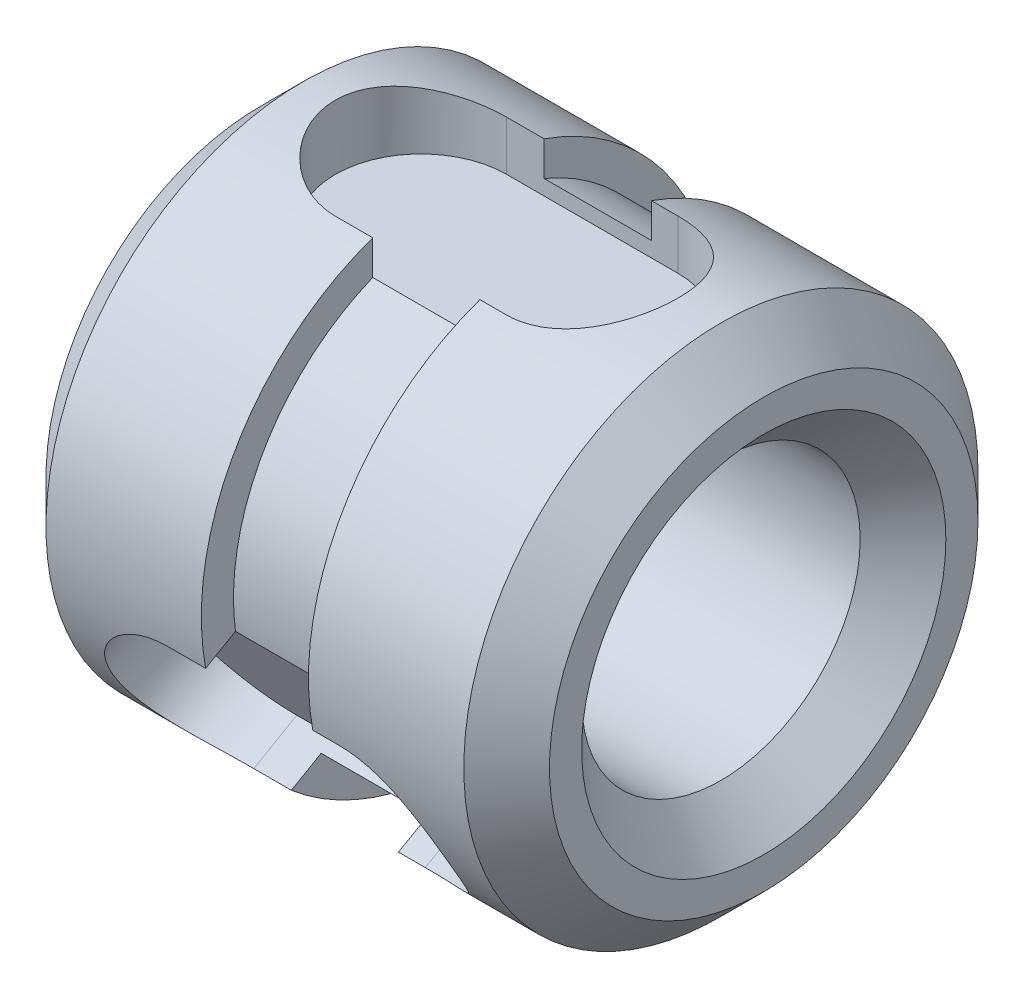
ISO-10303-21;
HEADER;
FILE_DESCRIPTION(('STEP AP214'),'2;1');
FILE_NAME('part.step','',(''),(''),'','','');
FILE_SCHEMA(('AUTOMOTIVE_DESIGN { 1 0 10303 214 1 1 1 1 }'));
ENDSEC;
DATA;
#1=APPLICATION_CONTEXT('core data for automotive mechanical design processes');
#2=APPLICATION_PROTOCOL_DEFINITION('international standard','automotive_design',2000,#1);
#3=PRODUCT_CONTEXT('',#1,'mechanical');
#4=PRODUCT('Part','Part','',(#3));
#5=PRODUCT_RELATED_PRODUCT_CATEGORY('part','',(#4));
#6=PRODUCT_DEFINITION_FORMATION('','',#4);
#7=PRODUCT_DEFINITION_CONTEXT('part definition',#1,'design');
#8=PRODUCT_DEFINITION('design','',#6,#7);
#9=PRODUCT_DEFINITION_SHAPE('','',#8);
#10=(LENGTH_UNIT() NAMED_UNIT(*) SI_UNIT(.MILLI.,.METRE.));
#11=(NAMED_UNIT(*) PLANE_ANGLE_UNIT() SI_UNIT($,.RADIAN.));
#12=(NAMED_UNIT(*) SI_UNIT($,.STERADIAN.) SOLID_ANGLE_UNIT());
#13=UNCERTAINTY_MEASURE_WITH_UNIT(LENGTH_MEASURE(1.E-05),#10,'distance_accuracy_value','');
#14=(GEOMETRIC_REPRESENTATION_CONTEXT(3) GLOBAL_UNCERTAINTY_ASSIGNED_CONTEXT((#13)) GLOBAL_UNIT_ASSIGNED_CONTEXT((#10,
#11,#12)) REPRESENTATION_CONTEXT('',''));
#15=CARTESIAN_POINT('',(0.,0.,0.));
#16=DIRECTION('',(0.,0.,1.));
#17=DIRECTION('',(1.,0.,0.));
#18=AXIS2_PLACEMENT_3D('',#15,#16,#17);
#19=CARTESIAN_POINT('',(0.,0.,0.));
#20=DIRECTION('',(1.,0.,0.));
#21=DIRECTION('',(0.,0.,-1.));
#22=AXIS2_PLACEMENT_3D('',#19,#20,#21);
#23=CYLINDRICAL_SURFACE('',#22,12.);
#24=CARTESIAN_POINT('',(-14.25,0.,0.));
#25=DIRECTION('',(-1.,0.,0.));
#26=DIRECTION('',(0.,0.,1.));
#27=AXIS2_PLACEMENT_3D('',#24,#25,#26);
#28=CIRCLE('',#27,12.);
#29=CARTESIAN_POINT('',(-14.25,-9.12095586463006,7.7979589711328));
#30=VERTEX_POINT('',#29);
#31=CARTESIAN_POINT('',(-14.25,-9.12095586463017,-7.79795897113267));
#32=VERTEX_POINT('',#31);
#33=EDGE_CURVE('E258',#30,#32,#28,.F.);
#34=ORIENTED_EDGE('',*,*,#33,.F.);
#35=DIRECTION('',(1.,0.,0.));
#36=VECTOR('',#35,1.);
#37=CARTESIAN_POINT('',(0.,-9.12095586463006,7.7979589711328));
#38=LINE('',#37,#36);
#39=CARTESIAN_POINT('',(-16.,-9.12095586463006,7.7979589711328));
#40=VERTEX_POINT('',#39);
#41=EDGE_CURVE('E452',#30,#40,#38,.F.);
#42=ORIENTED_EDGE('',*,*,#41,.T.);
#43=CARTESIAN_POINT('',(-16.,-9.12095586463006,7.7979589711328));
#44=CARTESIAN_POINT('',(-16.1091313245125,-9.12095961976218,7.79793670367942));
#45=CARTESIAN_POINT('',(-16.2182529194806,-9.11787766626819,7.80155898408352));
#46=CARTESIAN_POINT('',(-16.4356496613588,-9.10557461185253,7.81592439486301));
#47=CARTESIAN_POINT('',(-16.5439250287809,-9.09635516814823,7.82666560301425));
#48=CARTESIAN_POINT('',(-16.7585447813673,-9.07184560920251,7.85505881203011));
#49=CARTESIAN_POINT('',(-16.8648939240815,-9.05657349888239,7.87269031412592));
#50=CARTESIAN_POINT('',(-17.0752132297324,-9.0200286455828,7.91453410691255));
#51=CARTESIAN_POINT('',(-17.1791833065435,-8.99875568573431,7.93874663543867));
#52=CARTESIAN_POINT('',(-17.4863385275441,-8.92605695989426,8.02065452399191));
#53=CARTESIAN_POINT('',(-17.685086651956,-8.86571518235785,8.08766380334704));
#54=CARTESIAN_POINT('',(-18.0654028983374,-8.72202188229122,8.24241595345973));
#55=CARTESIAN_POINT('',(-18.246960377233,-8.6386562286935,8.33017155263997));
#56=CARTESIAN_POINT('',(-18.5948686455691,-8.44637906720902,8.52514181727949));
#57=CARTESIAN_POINT('',(-18.7604562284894,-8.33666955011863,8.63293411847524));
#58=CARTESIAN_POINT('',(-19.0648273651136,-8.09458197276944,8.86032096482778));
#59=CARTESIAN_POINT('',(-19.203606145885,-7.96219988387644,8.97991760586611));
#60=CARTESIAN_POINT('',(-19.4539171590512,-7.6726684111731,9.22862199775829));
#61=CARTESIAN_POINT('',(-19.5646436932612,-7.51496276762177,9.3578965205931));
#62=CARTESIAN_POINT('',(-19.7503692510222,-7.18024286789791,9.61711155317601));
#63=CARTESIAN_POINT('',(-19.8253791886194,-7.00323453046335,9.7470518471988));
#64=CARTESIAN_POINT('',(-19.9349428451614,-6.64053419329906,9.99750782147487));
#65=CARTESIAN_POINT('',(-19.9708130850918,-6.45535844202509,10.1181941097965));
#66=CARTESIAN_POINT('',(-20.0052651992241,-6.07603959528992,10.350417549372));
#67=CARTESIAN_POINT('',(-20.0038559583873,-5.88189864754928,10.4619568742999));
#68=CARTESIAN_POINT('',(-19.9646229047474,-5.49839453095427,10.6683294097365));
#69=CARTESIAN_POINT('',(-19.9282295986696,-5.30914265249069,10.7636462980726));
#70=CARTESIAN_POINT('',(-19.8224270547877,-4.93363447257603,10.9408582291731));
#71=CARTESIAN_POINT('',(-19.7530159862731,-4.74737833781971,11.0227525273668));
#72=CARTESIAN_POINT('',(-19.5823150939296,-4.38106740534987,11.1734517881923));
#73=CARTESIAN_POINT('',(-19.4806179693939,-4.20112639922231,11.2420704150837));
#74=CARTESIAN_POINT('',(-19.2485580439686,-3.8554644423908,11.3652590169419));
#75=CARTESIAN_POINT('',(-19.1181874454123,-3.68974737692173,11.4198251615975));
#76=CARTESIAN_POINT('',(-18.8253242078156,-3.37027999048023,11.5182670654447));
#77=CARTESIAN_POINT('',(-18.6616098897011,-3.21745808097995,11.5615198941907));
#78=CARTESIAN_POINT('',(-18.3102019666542,-2.9383575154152,11.6355905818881));
#79=CARTESIAN_POINT('',(-18.1225006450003,-2.81208743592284,11.6664044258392));
#80=CARTESIAN_POINT('',(-17.8252870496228,-2.64578701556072,11.7048326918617));
#81=CARTESIAN_POINT('',(-17.7227445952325,-2.5938932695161,11.7164021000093));
#82=CARTESIAN_POINT('',(-17.5134350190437,-2.49890301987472,11.7370289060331));
#83=CARTESIAN_POINT('',(-17.4066696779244,-2.45580285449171,11.7460873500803));
#84=CARTESIAN_POINT('',(-17.1897829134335,-2.37899268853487,11.7618847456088));
#85=CARTESIAN_POINT('',(-17.0796652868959,-2.34527247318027,11.7686262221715));
#86=CARTESIAN_POINT('',(-16.8568318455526,-2.28762905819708,11.7799665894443));
#87=CARTESIAN_POINT('',(-16.7441172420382,-2.26370138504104,11.7845664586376));
#88=CARTESIAN_POINT('',(-16.5263575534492,-2.22754129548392,11.7914539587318));
#89=CARTESIAN_POINT('',(-16.4214504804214,-2.21450434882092,11.7939015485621));
#90=CARTESIAN_POINT('',(-16.2110316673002,-2.19710624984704,11.7971495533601));
#91=CARTESIAN_POINT('',(-16.1055208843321,-2.19273390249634,11.7979520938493));
#92=CARTESIAN_POINT('',(-16.,-2.19275263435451,11.7979589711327));
#93=B_SPLINE_CURVE_WITH_KNOTS('',3,(#43,#44,#45,#46,#47,#48,#49,#50,#51,#52,#53,#54,#55,#56,#57,
#58,#59,#60,#61,#62,#63,#64,#65,#66,#67,#68,#69,#70,#71,#72,#73,#74,#75,#76,#77,#78,#79,#80,#81,
#82,#83,#84,#85,#86,#87,#88,#89,#90,#91,#92),.UNSPECIFIED.,.F.,.F.,(4,2,2,2,2,2,2,2,2,2,2,2,2,2,
2,2,2,2,2,2,2,2,2,2,4),(0.,0.327273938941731,0.654459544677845,0.980679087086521,
1.30691042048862,1.95841627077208,2.61032287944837,3.28524582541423,3.96028882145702,
4.65295094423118,5.34540127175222,6.01376445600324,6.68196834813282,7.32396236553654,
7.96599198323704,8.61646637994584,9.26711789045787,9.94834778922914,10.6297973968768,
10.9759539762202,11.3219661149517,11.6675999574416,12.0130757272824,12.3299368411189,
12.6463882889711),.UNSPECIFIED.);
#94=CARTESIAN_POINT('',(-16.,-2.19275263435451,11.7979589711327));
#95=VERTEX_POINT('',#94);
#96=EDGE_CURVE('E472',#40,#95,#93,.T.);
#97=ORIENTED_EDGE('',*,*,#96,.T.);
#98=DIRECTION('',(1.,0.,0.));
#99=VECTOR('',#98,1.);
#100=CARTESIAN_POINT('',(0.,-2.19275263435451,11.7979589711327));
#101=LINE('',#100,#99);
#102=CARTESIAN_POINT('',(-14.25,-2.19275263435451,11.7979589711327));
#103=VERTEX_POINT('',#102);
#104=EDGE_CURVE('E440',#95,#103,#101,.T.);
#105=ORIENTED_EDGE('',*,*,#104,.T.);
#106=CARTESIAN_POINT('',(-14.25,11.3137084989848,4.));
#107=VERTEX_POINT('',#106);
#108=EDGE_CURVE('E262',#107,#103,#28,.F.);
#109=ORIENTED_EDGE('',*,*,#108,.F.);
#110=DIRECTION('',(1.,0.,0.));
#111=VECTOR('',#110,1.);
#112=CARTESIAN_POINT('',(0.,11.3137084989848,4.));
#113=LINE('',#112,#111);
#114=CARTESIAN_POINT('',(-16.,11.3137084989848,4.));
#115=VERTEX_POINT('',#114);
#116=EDGE_CURVE('E403',#107,#115,#113,.F.);
#117=ORIENTED_EDGE('',*,*,#116,.T.);
#118=CARTESIAN_POINT('',(-16.,11.3137084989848,4.));
#119=CARTESIAN_POINT('',(-16.1091313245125,11.3136910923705,4.0000143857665));
#120=CARTESIAN_POINT('',(-16.2182529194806,11.3152871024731,3.99553419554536));
#121=CARTESIAN_POINT('',(-16.4356496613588,11.3215763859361,3.97769673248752));
#122=CARTESIAN_POINT('',(-16.5439250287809,11.3262688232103,3.96434185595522));
#123=CARTESIAN_POINT('',(-16.7585447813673,11.3386032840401,3.92891935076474));
#124=CARTESIAN_POINT('',(-16.8648939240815,11.3462365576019,3.90687756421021));
#125=CARTESIAN_POINT('',(-17.0752132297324,11.364201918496,3.85430689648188));
#126=CARTESIAN_POINT('',(-17.1791833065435,11.3745341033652,3.82377770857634));
#127=CARTESIAN_POINT('',(-17.4863385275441,11.4091190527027,3.71986482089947));
#128=CARTESIAN_POINT('',(-17.685086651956,11.4369799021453,3.63410266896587));
#129=CARTESIAN_POINT('',(-18.0654028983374,11.4991525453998,3.4322845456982));
#130=CARTESIAN_POINT('',(-18.246960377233,11.5334682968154,3.31620997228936));
#131=CARTESIAN_POINT('',(-18.5948686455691,11.6061789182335,3.05220793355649));
#132=CARTESIAN_POINT('',(-18.7604562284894,11.6446750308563,2.90330055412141));
#133=CARTESIAN_POINT('',(-19.0648273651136,11.7205540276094,2.57995313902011));
#134=CARTESIAN_POINT('',(-19.203606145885,11.7579367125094,2.40550856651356));
#135=CARTESIAN_POINT('',(-19.4539171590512,11.8285552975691,2.03041476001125));
#136=CARTESIAN_POINT('',(-19.5646436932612,11.8616574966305,1.82920040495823));
#137=CARTESIAN_POINT('',(-19.7503692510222,11.9187843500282,1.40971695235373));
#138=CARTESIAN_POINT('',(-19.8253791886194,11.9428117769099,1.19145308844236));
#139=CARTESIAN_POINT('',(-19.9349428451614,11.9783628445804,0.752117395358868));
#140=CARTESIAN_POINT('',(-19.9708130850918,11.9902923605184,0.53140734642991));
#141=CARTESIAN_POINT('',(-20.0052651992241,12.0017443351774,0.0867958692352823));
#142=CARTESIAN_POINT('',(-20.0038559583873,12.0012697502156,-0.137104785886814));
#143=CARTESIAN_POINT('',(-19.9646229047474,11.9882415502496,-0.572415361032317));
#144=CARTESIAN_POINT('',(-19.9282295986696,11.9761624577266,-0.783970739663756));
#145=CARTESIAN_POINT('',(-19.8224270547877,11.9418784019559,-1.19777632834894));
#146=CARTESIAN_POINT('',(-19.7530159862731,11.9196728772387,-1.4000260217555));
#147=CARTESIAN_POINT('',(-19.5823150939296,11.8670267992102,-1.79261022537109));
#148=CARTESIAN_POINT('',(-19.4806179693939,11.8364817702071,-1.98275302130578));
#149=CARTESIAN_POINT('',(-19.2485580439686,11.7703352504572,-2.34369935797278));
#150=CARTESIAN_POINT('',(-19.1181874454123,11.7347323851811,-2.51449761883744));
#151=CARTESIAN_POINT('',(-18.8253242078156,11.6602518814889,-2.84038544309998));
#152=CARTESIAN_POINT('',(-18.6616098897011,11.6212989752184,-2.99435951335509));
#153=CARTESIAN_POINT('',(-18.3102019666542,11.5458957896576,-3.27310303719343));
#154=CARTESIAN_POINT('',(-18.1225006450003,11.5094463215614,-3.39786305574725));
#155=CARTESIAN_POINT('',(-17.8252870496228,11.4595759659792,-3.56109757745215));
#156=CARTESIAN_POINT('',(-17.7227445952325,11.4436484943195,-3.61182358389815));
#157=CARTESIAN_POINT('',(-17.5134350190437,11.4140167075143,-3.70440095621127));
#158=CARTESIAN_POINT('',(-17.4066696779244,11.4003114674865,-3.74625601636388));
#159=CARTESIAN_POINT('',(-17.1897829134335,11.3755873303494,-3.82067426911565));
#160=CARTESIAN_POINT('',(-17.0796652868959,11.3645655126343,-3.85324757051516));
#161=CARTESIAN_POINT('',(-16.8568318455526,11.3455648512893,-3.90883841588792));
#162=CARTESIAN_POINT('',(-16.7441172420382,11.3375846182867,-3.93186032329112));
#163=CARTESIAN_POINT('',(-16.5263575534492,11.3254693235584,-3.96661962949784));
#164=CARTESIAN_POINT('',(-16.4214504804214,11.3210705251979,-3.97913375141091));
#165=CARTESIAN_POINT('',(-16.2110316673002,11.3151843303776,-3.99582494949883));
#166=CARTESIAN_POINT('',(-16.1055208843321,11.3136931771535,-4.00001278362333));
#167=CARTESIAN_POINT('',(-16.,11.3137084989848,-4.));
#168=B_SPLINE_CURVE_WITH_KNOTS('',3,(#118,#119,#120,#121,#122,#123,#124,#125,#126,#127,#128,
#129,#130,#131,#132,#133,#134,#135,#136,#137,#138,#139,#140,#141,#142,#143,#144,#145,#146,#147,
#148,#149,#150,#151,#152,#153,#154,#155,#156,#157,#158,#159,#160,#161,#162,#163,#164,#165,#166,
#167),.UNSPECIFIED.,.F.,.F.,(4,2,2,2,2,2,2,2,2,2,2,2,2,2,2,2,2,2,2,2,2,2,2,2,4),(0.,
0.327273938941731,0.654459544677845,0.980679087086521,1.30691042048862,1.95841627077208,
2.61032287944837,3.28524582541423,3.96028882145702,4.65295094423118,5.34540127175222,
6.01376445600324,6.68196834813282,7.32396236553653,7.96599198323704,8.61646637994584,
9.26711789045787,9.94834778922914,10.6297973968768,10.9759539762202,11.3219661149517,
11.6675999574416,12.0130757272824,12.3299368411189,12.6463882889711),.UNSPECIFIED.);
#169=CARTESIAN_POINT('',(-16.,11.3137084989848,-4.));
#170=VERTEX_POINT('',#169);
#171=EDGE_CURVE('E427',#115,#170,#168,.T.);
#172=ORIENTED_EDGE('',*,*,#171,.T.);
#173=DIRECTION('',(1.,0.,0.));
#174=VECTOR('',#173,1.);
#175=CARTESIAN_POINT('',(0.,11.3137084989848,-4.));
#176=LINE('',#175,#174);
#177=CARTESIAN_POINT('',(-14.25,11.3137084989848,-4.));
#178=VERTEX_POINT('',#177);
#179=EDGE_CURVE('E435',#170,#178,#176,.T.);
#180=ORIENTED_EDGE('',*,*,#179,.T.);
#181=CARTESIAN_POINT('',(-14.25,-2.19275263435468,-11.7979589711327));
#182=VERTEX_POINT('',#181);
#183=EDGE_CURVE('E263',#182,#178,#28,.F.);
#184=ORIENTED_EDGE('',*,*,#183,.F.);
#185=DIRECTION('',(1.,0.,0.));
#186=VECTOR('',#185,1.);
#187=CARTESIAN_POINT('',(0.,-2.19275263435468,-11.7979589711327));
#188=LINE('',#187,#186);
#189=CARTESIAN_POINT('',(-16.,-2.19275263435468,-11.7979589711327));
#190=VERTEX_POINT('',#189);
#191=EDGE_CURVE('E493',#182,#190,#188,.F.);
#192=ORIENTED_EDGE('',*,*,#191,.T.);
#193=CARTESIAN_POINT('',(-16.,-2.19275263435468,-11.7979589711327));
#194=CARTESIAN_POINT('',(-16.1091313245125,-2.19273147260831,-11.7979510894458));
#195=CARTESIAN_POINT('',(-16.2182529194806,-2.1974094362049,-11.7970931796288));
#196=CARTESIAN_POINT('',(-16.4356496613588,-2.21600177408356,-11.7936211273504));
#197=CARTESIAN_POINT('',(-16.5439250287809,-2.22991365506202,-11.7910074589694));
#198=CARTESIAN_POINT('',(-16.7585447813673,-2.26675767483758,-11.7839781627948));
#199=CARTESIAN_POINT('',(-16.8648939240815,-2.28966305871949,-11.779567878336));
#200=CARTESIAN_POINT('',(-17.0752132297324,-2.3441732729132,-11.7688410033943));
#201=CARTESIAN_POINT('',(-17.1791833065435,-2.37577841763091,-11.7625243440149));
#202=CARTESIAN_POINT('',(-17.4863385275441,-2.4830620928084,-11.7405193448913));
#203=CARTESIAN_POINT('',(-17.685086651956,-2.57126471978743,-11.7217664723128));
#204=CARTESIAN_POINT('',(-18.0654028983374,-2.7771306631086,-11.6747004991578));
#205=CARTESIAN_POINT('',(-18.246960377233,-2.89481206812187,-11.6463815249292));
#206=CARTESIAN_POINT('',(-18.5948686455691,-3.1597998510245,-11.5773497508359));
#207=CARTESIAN_POINT('',(-18.7604562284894,-3.30800548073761,-11.5362346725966));
#208=CARTESIAN_POINT('',(-19.0648273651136,-3.62597205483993,-11.4402741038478));
#209=CARTESIAN_POINT('',(-19.203606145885,-3.79573682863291,-11.3854261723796));
#210=CARTESIAN_POINT('',(-19.4539171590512,-4.15588688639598,-11.2590367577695));
#211=CARTESIAN_POINT('',(-19.5646436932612,-4.34669472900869,-11.1870969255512));
#212=CARTESIAN_POINT('',(-19.7503692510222,-4.73854148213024,-11.0268285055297));
#213=CARTESIAN_POINT('',(-19.8253791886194,-4.93957724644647,-10.9385049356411));
#214=CARTESIAN_POINT('',(-19.9349428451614,-5.33782865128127,-10.7496252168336));
#215=CARTESIAN_POINT('',(-19.9708130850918,-5.53493391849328,-10.6496014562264));
#216=CARTESIAN_POINT('',(-20.0052651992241,-5.92570473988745,-10.4372134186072));
#217=CARTESIAN_POINT('',(-20.0038559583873,-6.11937110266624,-10.324852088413));
#218=CARTESIAN_POINT('',(-19.9646229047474,-6.48984701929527,-10.0959140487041));
#219=CARTESIAN_POINT('',(-19.9282295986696,-6.66701980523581,-9.97967555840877));
#220=CARTESIAN_POINT('',(-19.8224270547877,-7.00824392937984,-9.74308190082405));
#221=CARTESIAN_POINT('',(-19.7530159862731,-7.17229453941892,-9.62272650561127));
#222=CARTESIAN_POINT('',(-19.5823150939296,-7.48595939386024,-9.38084156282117));
#223=CARTESIAN_POINT('',(-19.4806179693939,-7.63535537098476,-9.25931739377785));
#224=CARTESIAN_POINT('',(-19.2485580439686,-7.91487080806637,-9.02155965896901));
#225=CARTESIAN_POINT('',(-19.1181874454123,-8.04498500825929,-8.90532754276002));
#226=CARTESIAN_POINT('',(-18.8253242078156,-8.28997189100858,-8.67788162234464));
#227=CARTESIAN_POINT('',(-18.6616098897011,-8.40384089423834,-8.56716038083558));
#228=CARTESIAN_POINT('',(-18.3102019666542,-8.60753827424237,-8.36248754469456));
#229=CARTESIAN_POINT('',(-18.1225006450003,-8.69735888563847,-8.26854137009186));
#230=CARTESIAN_POINT('',(-17.8252870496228,-8.81378895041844,-8.1437351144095));
#231=CARTESIAN_POINT('',(-17.7227445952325,-8.84975522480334,-8.10457851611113));
#232=CARTESIAN_POINT('',(-17.5134350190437,-8.91511368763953,-8.03262794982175));
#233=CARTESIAN_POINT('',(-17.4066696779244,-8.94450861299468,-7.99983133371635));
#234=CARTESIAN_POINT('',(-17.1897829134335,-8.99659464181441,-7.94121047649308));
#235=CARTESIAN_POINT('',(-17.0796652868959,-9.01929303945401,-7.91537865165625));
#236=CARTESIAN_POINT('',(-16.8568318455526,-9.05793579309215,-7.87112817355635));
#237=CARTESIAN_POINT('',(-16.7441172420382,-9.07388323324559,-7.85270613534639));
#238=CARTESIAN_POINT('',(-16.5263575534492,-9.09792802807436,-7.82483432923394));
#239=CARTESIAN_POINT('',(-16.4214504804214,-9.10656617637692,-7.81476779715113));
#240=CARTESIAN_POINT('',(-16.2110316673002,-9.11807808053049,-7.80132460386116));
#241=CARTESIAN_POINT('',(-16.1055208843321,-9.12095927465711,-7.79793931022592));
#242=CARTESIAN_POINT('',(-16.,-9.12095586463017,-7.79795897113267));
#243=B_SPLINE_CURVE_WITH_KNOTS('',3,(#193,#194,#195,#196,#197,#198,#199,#200,#201,#202,#203,
#204,#205,#206,#207,#208,#209,#210,#211,#212,#213,#214,#215,#216,#217,#218,#219,#220,#221,#222,
#223,#224,#225,#226,#227,#228,#229,#230,#231,#232,#233,#234,#235,#236,#237,#238,#239,#240,#241,
#242),.UNSPECIFIED.,.F.,.F.,(4,2,2,2,2,2,2,2,2,2,2,2,2,2,2,2,2,2,2,2,2,2,2,2,4),(0.,
0.327273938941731,0.654459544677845,0.980679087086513,1.30691042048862,1.95841627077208,
2.61032287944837,3.28524582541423,3.96028882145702,4.65295094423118,5.34540127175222,
6.01376445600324,6.68196834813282,7.32396236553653,7.96599198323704,8.61646637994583,
9.26711789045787,9.94834778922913,10.6297973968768,10.9759539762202,11.3219661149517,
11.6675999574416,12.0130757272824,12.3299368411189,12.6463882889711),.UNSPECIFIED.);
#244=CARTESIAN_POINT('',(-16.,-9.12095586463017,-7.79795897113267));
#245=VERTEX_POINT('',#244);
#246=EDGE_CURVE('E513',#190,#245,#243,.T.);
#247=ORIENTED_EDGE('',*,*,#246,.T.);
#248=DIRECTION('',(1.,0.,0.));
#249=VECTOR('',#248,1.);
#250=CARTESIAN_POINT('',(0.,-9.12095586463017,-7.79795897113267));
#251=LINE('',#250,#249);
#252=EDGE_CURVE('E481',#245,#32,#251,.T.);
#253=ORIENTED_EDGE('',*,*,#252,.T.);
#254=EDGE_LOOP('',(#34,#42,#97,#105,#109,#117,#172,#180,#184,#192,#247,#253));
#255=FACE_BOUND('',#254,.T.);
#256=CARTESIAN_POINT('',(-21.5,0.,0.));
#257=DIRECTION('',(1.,0.,0.));
#258=DIRECTION('',(0.,0.,-1.));
#259=AXIS2_PLACEMENT_3D('',#256,#257,#258);
#260=CIRCLE('',#259,12.);
#261=CARTESIAN_POINT('',(-21.5,0.,-12.));
#262=VERTEX_POINT('',#261);
#263=EDGE_CURVE('E386',#262,#262,#260,.T.);
#264=ORIENTED_EDGE('',*,*,#263,.T.);
#265=EDGE_LOOP('',(#264));
#266=FACE_BOUND('',#265,.T.);
#267=ADVANCED_FACE('F47',(#255,#266),#23,.T.);
#268=CARTESIAN_POINT('',(-9.25,0.,0.));
#269=DIRECTION('',(1.,0.,0.));
#270=DIRECTION('',(0.,0.,-1.));
#271=AXIS2_PLACEMENT_3D('',#268,#269,#270);
#272=CIRCLE('',#271,12.);
#273=CARTESIAN_POINT('',(-9.25,-9.12095586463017,-7.79795897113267));
#274=VERTEX_POINT('',#273);
#275=CARTESIAN_POINT('',(-9.25,-9.12095586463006,7.7979589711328));
#276=VERTEX_POINT('',#275);
#277=EDGE_CURVE('E241',#274,#276,#272,.F.);
#278=ORIENTED_EDGE('',*,*,#277,.F.);
#279=CARTESIAN_POINT('',(-8.,-9.12095586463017,-7.79795897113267));
#280=VERTEX_POINT('',#279);
#281=EDGE_CURVE('E480',#274,#280,#251,.T.);
#282=ORIENTED_EDGE('',*,*,#281,.T.);
#283=CARTESIAN_POINT('',(-8.,-9.12095586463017,-7.79795897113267));
#284=CARTESIAN_POINT('',(-7.78212730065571,-9.12095639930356,-7.79795783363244));
#285=CARTESIAN_POINT('',(-7.56426080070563,-9.10866903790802,-7.81239929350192));
#286=CARTESIAN_POINT('',(-7.134982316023,-9.05972716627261,-7.8690987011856));
#287=CARTESIAN_POINT('',(-6.92357140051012,-9.02306864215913,-7.91136123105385));
#288=CARTESIAN_POINT('',(-6.51349242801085,-8.92602437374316,-8.02068383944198));
#289=CARTESIAN_POINT('',(-6.31480028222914,-8.86568512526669,-8.08769530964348));
#290=CARTESIAN_POINT('',(-5.93455980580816,-8.72199511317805,-8.24244565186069));
#291=CARTESIAN_POINT('',(-5.75301526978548,-8.63863927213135,-8.33018909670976));
#292=CARTESIAN_POINT('',(-5.40512015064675,-8.44637649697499,-8.52514406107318));
#293=CARTESIAN_POINT('',(-5.23953828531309,-8.33666717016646,-8.63293637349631));
#294=CARTESIAN_POINT('',(-4.93517279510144,-8.09458011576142,-8.86032268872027));
#295=CARTESIAN_POINT('',(-4.79639347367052,-7.96219875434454,-8.97991858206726));
#296=CARTESIAN_POINT('',(-4.54608441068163,-7.67267093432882,-9.22861982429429));
#297=CARTESIAN_POINT('',(-4.43536011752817,-7.51496844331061,-9.35789187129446));
#298=CARTESIAN_POINT('',(-4.24963365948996,-7.18024930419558,-9.61710682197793));
#299=CARTESIAN_POINT('',(-4.17462186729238,-7.00323787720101,-9.74704953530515));
#300=CARTESIAN_POINT('',(-4.06505658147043,-6.64053243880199,-9.99750903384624));
#301=CARTESIAN_POINT('',(-4.02918621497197,-6.45535481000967,-10.118196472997));
#302=CARTESIAN_POINT('',(-3.99473482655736,-6.07603580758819,-10.3504197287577));
#303=CARTESIAN_POINT('',(-3.99614419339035,-5.8818967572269,-10.4619578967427));
#304=CARTESIAN_POINT('',(-4.03537701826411,-5.49839567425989,-10.6683287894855));
#305=CARTESIAN_POINT('',(-4.07177011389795,-5.30914492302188,-10.7636451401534));
#306=CARTESIAN_POINT('',(-4.17757192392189,-4.93363684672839,-10.9408571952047));
#307=CARTESIAN_POINT('',(-4.2469828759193,-4.74737972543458,-11.0227519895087));
#308=CARTESIAN_POINT('',(-4.41768526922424,-4.38106769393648,-11.1734516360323));
#309=CARTESIAN_POINT('',(-4.51938375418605,-4.20112648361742,-11.2420702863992));
#310=CARTESIAN_POINT('',(-4.75143882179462,-3.85546645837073,-11.3652583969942));
#311=CARTESIAN_POINT('',(-4.88180337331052,-3.68975161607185,-11.4198239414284));
#312=CARTESIAN_POINT('',(-5.1746975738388,-3.37026227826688,-11.5182724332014));
#313=CARTESIAN_POINT('',(-5.33845263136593,-3.21741729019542,-11.5615314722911));
#314=CARTESIAN_POINT('',(-5.68979490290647,-2.93835112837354,-11.6355915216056));
#315=CARTESIAN_POINT('',(-5.87738578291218,-2.81213405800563,-11.6663906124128));
#316=CARTESIAN_POINT('',(-6.27461450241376,-2.58990609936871,-11.717748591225));
#317=CARTESIAN_POINT('',(-6.48452852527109,-2.49435149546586,-11.7381552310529));
#318=CARTESIAN_POINT('',(-6.91828557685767,-2.34070379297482,-11.7697634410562));
#319=CARTESIAN_POINT('',(-7.14212272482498,-2.28259499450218,-11.78096886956));
#320=CARTESIAN_POINT('',(-7.5865534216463,-2.20878882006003,-11.7950247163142));
#321=CARTESIAN_POINT('',(-7.80683769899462,-2.19129628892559,-11.7982292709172));
#322=CARTESIAN_POINT('',(-8.24710459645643,-2.1943986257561,-11.7976534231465));
#323=CARTESIAN_POINT('',(-8.46708726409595,-2.21498657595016,-11.7938742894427));
#324=CARTESIAN_POINT('',(-8.89262786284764,-2.29172750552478,-11.7791936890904));
#325=CARTESIAN_POINT('',(-9.09842172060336,-2.34663450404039,-11.7685413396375));
#326=CARTESIAN_POINT('',(-9.49817442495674,-2.48821188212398,-11.7394203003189));
#327=CARTESIAN_POINT('',(-9.69213116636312,-2.57488789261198,-11.7209502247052));
#328=CARTESIAN_POINT('',(-10.069521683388,-2.77955930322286,-11.6741326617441));
#329=CARTESIAN_POINT('',(-10.2524265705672,-2.89846088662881,-11.6454904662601));
#330=CARTESIAN_POINT('',(-10.5965842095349,-3.16164126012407,-11.5768083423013));
#331=CARTESIAN_POINT('',(-10.7578305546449,-3.30592753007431,-11.5367650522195));
#332=CARTESIAN_POINT('',(-11.0621119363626,-3.62246627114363,-11.4414292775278));
#333=CARTESIAN_POINT('',(-11.2038975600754,-3.79573025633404,-11.3854958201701));
#334=CARTESIAN_POINT('',(-11.4556645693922,-4.1588357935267,-11.2579332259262));
#335=CARTESIAN_POINT('',(-11.5656470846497,-4.34867675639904,-11.1863046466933));
#336=CARTESIAN_POINT('',(-11.7496804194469,-4.73722282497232,-11.0273495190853));
#337=CARTESIAN_POINT('',(-11.8239651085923,-4.93586065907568,-10.9401304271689));
#338=CARTESIAN_POINT('',(-11.9349109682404,-5.33633294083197,-10.7504675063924));
#339=CARTESIAN_POINT('',(-11.971585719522,-5.53816620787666,-10.6480291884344));
#340=CARTESIAN_POINT('',(-12.0050483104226,-5.92873082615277,-10.4353857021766));
#341=CARTESIAN_POINT('',(-12.0036298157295,-6.11763211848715,-10.3257718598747));
#342=CARTESIAN_POINT('',(-11.9653707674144,-6.48653137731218,-10.0981127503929));
#343=CARTESIAN_POINT('',(-11.9285330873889,-6.66653006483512,-9.9800681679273));
#344=CARTESIAN_POINT('',(-11.8216710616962,-7.01019468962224,-9.74167641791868));
#345=CARTESIAN_POINT('',(-11.7521831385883,-7.1740746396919,-9.62139560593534));
#346=CARTESIAN_POINT('',(-11.5824898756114,-7.48538574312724,-9.38124161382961));
#347=CARTESIAN_POINT('',(-11.4822789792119,-7.63281391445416,-9.26136851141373));
#348=CARTESIAN_POINT('',(-11.249721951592,-7.91401311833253,-9.02240068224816));
#349=CARTESIAN_POINT('',(-11.1163252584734,-8.04707825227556,-8.90349837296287));
#350=CARTESIAN_POINT('',(-10.8229704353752,-8.29138465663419,-8.67645128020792));
#351=CARTESIAN_POINT('',(-10.6630038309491,-8.40261893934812,-8.5683099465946));
#352=CARTESIAN_POINT('',(-10.3135625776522,-8.60600631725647,-8.36410572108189));
#353=CARTESIAN_POINT('',(-10.1231779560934,-8.69724202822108,-8.26868135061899));
#354=CARTESIAN_POINT('',(-9.72266229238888,-8.85384064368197,-8.10078709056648));
#355=CARTESIAN_POINT('',(-9.51253642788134,-8.91921030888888,-8.02831120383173));
#356=CARTESIAN_POINT('',(-9.08815270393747,-9.02087964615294,-7.9138712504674));
#357=CARTESIAN_POINT('',(-8.87451094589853,-9.05835976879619,-7.87067607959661));
#358=CARTESIAN_POINT('',(-8.44057579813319,-9.10839330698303,-7.81272542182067));
#359=CARTESIAN_POINT('',(-8.22028473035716,-9.12095532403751,-7.79796012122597));
#360=CARTESIAN_POINT('',(-8.,-9.12095586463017,-7.79795897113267));
#361=B_SPLINE_CURVE_WITH_KNOTS('',3,(#283,#284,#285,#286,#287,#288,#289,#290,#291,#292,#293,
#294,#295,#296,#297,#298,#299,#300,#301,#302,#303,#304,#305,#306,#307,#308,#309,#310,#311,#312,
#313,#314,#315,#316,#317,#318,#319,#320,#321,#322,#323,#324,#325,#326,#327,#328,#329,#330,#331,
#332,#333,#334,#335,#336,#337,#338,#339,#340,#341,#342,#343,#344,#345,#346,#347,#348,#349,#350,
#351,#352,#353,#354,#355,#356,#357,#358,#359,#360),.UNSPECIFIED.,.T.,.F.,(4,2,2,2,2,2,2,2,2,2,2,
2,2,2,2,2,2,2,2,2,2,2,2,2,2,2,2,2,2,2,2,2,2,2,2,2,2,2,4),(0.,0.652802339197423,1.30571222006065,
1.95734651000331,2.60912466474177,3.28405349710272,3.95909060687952,4.65174024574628,
5.34420305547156,6.01257275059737,6.68077013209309,7.32276019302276,7.96479376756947,
8.6152661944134,9.26591967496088,9.9472069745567,10.6285991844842,11.3197055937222,
12.0105220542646,12.6701716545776,13.3297014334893,13.966575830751,14.6035631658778,
15.2607543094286,15.9181394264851,16.6071523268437,17.2961407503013,17.9805516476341,
18.6647153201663,19.3167233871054,19.9686785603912,20.6102782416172,21.2519940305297,
21.9174207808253,22.5830601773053,23.2747561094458,23.9662711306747,24.6265284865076,
25.2865578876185),.UNSPECIFIED.);
#362=CARTESIAN_POINT('',(-8.,-2.19275263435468,-11.7979589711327));
#363=VERTEX_POINT('',#362);
#364=EDGE_CURVE('E485',#280,#363,#361,.T.);
#365=ORIENTED_EDGE('',*,*,#364,.T.);
#366=CARTESIAN_POINT('',(-9.25,-2.19275263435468,-11.7979589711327));
#367=VERTEX_POINT('',#366);
#368=EDGE_CURVE('E494',#363,#367,#188,.F.);
#369=ORIENTED_EDGE('',*,*,#368,.T.);
#370=CARTESIAN_POINT('',(-9.25,11.3137084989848,-4.));
#371=VERTEX_POINT('',#370);
#372=EDGE_CURVE('E71',#371,#367,#272,.F.);
#373=ORIENTED_EDGE('',*,*,#372,.F.);
#374=CARTESIAN_POINT('',(-8.,11.3137084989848,-4.));
#375=VERTEX_POINT('',#374);
#376=EDGE_CURVE('E232',#371,#375,#176,.T.);
#377=ORIENTED_EDGE('',*,*,#376,.T.);
#378=CARTESIAN_POINT('',(-8.,11.3137084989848,-4.));
#379=CARTESIAN_POINT('',(-7.89086867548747,11.3136910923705,-4.0000143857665));
#380=CARTESIAN_POINT('',(-7.78174708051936,11.3152871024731,-3.99553419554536));
#381=CARTESIAN_POINT('',(-7.5643503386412,11.3215763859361,-3.97769673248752));
#382=CARTESIAN_POINT('',(-7.45607497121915,11.3262688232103,-3.96434185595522));
#383=CARTESIAN_POINT('',(-7.24145521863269,11.3386032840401,-3.92891935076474));
#384=CARTESIAN_POINT('',(-7.13510607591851,11.3462365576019,-3.90687756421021));
#385=CARTESIAN_POINT('',(-6.92478677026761,11.364201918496,-3.85430689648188));
#386=CARTESIAN_POINT('',(-6.82081669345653,11.3745341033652,-3.82377770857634));
#387=CARTESIAN_POINT('',(-6.5136614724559,11.4091190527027,-3.71986482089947));
#388=CARTESIAN_POINT('',(-6.31491334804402,11.4369799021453,-3.63410266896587));
#389=CARTESIAN_POINT('',(-5.93459710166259,11.4991525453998,-3.4322845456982));
#390=CARTESIAN_POINT('',(-5.75303962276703,11.5334682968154,-3.31620997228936));
#391=CARTESIAN_POINT('',(-5.40513135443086,11.6061789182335,-3.05220793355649));
#392=CARTESIAN_POINT('',(-5.23954377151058,11.6446750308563,-2.90330055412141));
#393=CARTESIAN_POINT('',(-4.9351726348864,11.7205540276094,-2.57995313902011));
#394=CARTESIAN_POINT('',(-4.79639385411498,11.7579367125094,-2.40550856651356));
#395=CARTESIAN_POINT('',(-4.5460828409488,11.8285552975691,-2.03041476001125));
#396=CARTESIAN_POINT('',(-4.43535630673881,11.8616574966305,-1.82920040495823));
#397=CARTESIAN_POINT('',(-4.24963074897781,11.9187843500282,-1.40971695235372));
#398=CARTESIAN_POINT('',(-4.17462081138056,11.9428117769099,-1.19145308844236));
#399=CARTESIAN_POINT('',(-4.06505715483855,11.9783628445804,-0.752117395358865));
#400=CARTESIAN_POINT('',(-4.02918691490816,11.9902923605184,-0.531407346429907));
#401=CARTESIAN_POINT('',(-3.99473480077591,12.0017443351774,-0.0867958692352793));
#402=CARTESIAN_POINT('',(-3.99614404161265,12.0012697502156,0.137104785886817));
#403=CARTESIAN_POINT('',(-4.03537709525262,11.9882415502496,0.572415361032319));
#404=CARTESIAN_POINT('',(-4.07177040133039,11.9761624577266,0.783970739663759));
#405=CARTESIAN_POINT('',(-4.1775729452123,11.9418784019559,1.19777632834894));
#406=CARTESIAN_POINT('',(-4.24698401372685,11.9196728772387,1.4000260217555));
#407=CARTESIAN_POINT('',(-4.41768490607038,11.8670267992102,1.79261022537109));
#408=CARTESIAN_POINT('',(-4.51938203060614,11.8364817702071,1.98275302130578));
#409=CARTESIAN_POINT('',(-4.7514419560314,11.7703352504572,2.34369935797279));
#410=CARTESIAN_POINT('',(-4.88181255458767,11.7347323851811,2.51449761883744));
#411=CARTESIAN_POINT('',(-5.17467579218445,11.6602518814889,2.84038544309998));
#412=CARTESIAN_POINT('',(-5.33839011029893,11.6212989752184,2.99435951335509));
#413=CARTESIAN_POINT('',(-5.68979803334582,11.5458957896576,3.27310303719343));
#414=CARTESIAN_POINT('',(-5.87749935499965,11.5094463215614,3.39786305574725));
#415=CARTESIAN_POINT('',(-6.17471295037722,11.4595759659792,3.56109757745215));
#416=CARTESIAN_POINT('',(-6.27725540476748,11.4436484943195,3.61182358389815));
#417=CARTESIAN_POINT('',(-6.48656498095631,11.4140167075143,3.70440095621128));
#418=CARTESIAN_POINT('',(-6.5933303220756,11.4003114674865,3.74625601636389));
#419=CARTESIAN_POINT('',(-6.81021708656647,11.3755873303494,3.82067426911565));
#420=CARTESIAN_POINT('',(-6.92033471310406,11.3645655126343,3.85324757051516));
#421=CARTESIAN_POINT('',(-7.14316815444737,11.3455648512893,3.90883841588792));
#422=CARTESIAN_POINT('',(-7.25588275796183,11.3375846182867,3.93186032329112));
#423=CARTESIAN_POINT('',(-7.47364244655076,11.3254693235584,3.96661962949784));
#424=CARTESIAN_POINT('',(-7.57854951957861,11.3210705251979,3.97913375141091));
#425=CARTESIAN_POINT('',(-7.78896833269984,11.3151843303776,3.99582494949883));
#426=CARTESIAN_POINT('',(-7.89447911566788,11.3136931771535,4.00001278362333));
#427=CARTESIAN_POINT('',(-8.,11.3137084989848,4.));
#428=B_SPLINE_CURVE_WITH_KNOTS('',3,(#378,#379,#380,#381,#382,#383,#384,#385,#386,#387,#388,
#389,#390,#391,#392,#393,#394,#395,#396,#397,#398,#399,#400,#401,#402,#403,#404,#405,#406,#407,
#408,#409,#410,#411,#412,#413,#414,#415,#416,#417,#418,#419,#420,#421,#422,#423,#424,#425,#426,
#427),.UNSPECIFIED.,.F.,.F.,(4,2,2,2,2,2,2,2,2,2,2,2,2,2,2,2,2,2,2,2,2,2,2,2,4),(0.,
0.32727393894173,0.654459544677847,0.980679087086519,1.30691042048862,1.95841627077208,
2.61032287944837,3.28524582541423,3.96028882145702,4.65295094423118,5.34540127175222,
6.01376445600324,6.68196834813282,7.32396236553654,7.96599198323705,8.61646637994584,
9.26711789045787,9.94834778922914,10.6297973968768,10.9759539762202,11.3219661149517,
11.6675999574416,12.0130757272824,12.3299368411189,12.6463882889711),.UNSPECIFIED.);
#429=CARTESIAN_POINT('',(-8.,11.3137084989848,4.));
#430=VERTEX_POINT('',#429);
#431=EDGE_CURVE('E394',#375,#430,#428,.T.);
#432=ORIENTED_EDGE('',*,*,#431,.T.);
#433=CARTESIAN_POINT('',(-9.25,11.3137084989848,4.));
#434=VERTEX_POINT('',#433);
#435=EDGE_CURVE('E404',#430,#434,#113,.F.);
#436=ORIENTED_EDGE('',*,*,#435,.T.);
#437=CARTESIAN_POINT('',(-9.25,-2.19275263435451,11.7979589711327));
#438=VERTEX_POINT('',#437);
#439=EDGE_CURVE('E238',#438,#434,#272,.F.);
#440=ORIENTED_EDGE('',*,*,#439,.F.);
#441=CARTESIAN_POINT('',(-8.,-2.19275263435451,11.7979589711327));
#442=VERTEX_POINT('',#441);
#443=EDGE_CURVE('E439',#438,#442,#101,.T.);
#444=ORIENTED_EDGE('',*,*,#443,.T.);
#445=CARTESIAN_POINT('',(-8.,-2.19275263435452,11.7979589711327));
#446=CARTESIAN_POINT('',(-7.78212730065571,-2.19275138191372,11.7979588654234));
#447=CARTESIAN_POINT('',(-7.56426080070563,-2.2114017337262,11.7945384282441));
#448=CARTESIAN_POINT('',(-7.134982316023,-2.2849757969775,11.7805032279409));
#449=CARTESIAN_POINT('',(-6.92357140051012,-2.33990548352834,11.7698872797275));
#450=CARTESIAN_POINT('',(-6.51349242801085,-2.48310377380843,11.7405057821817));
#451=CARTESIAN_POINT('',(-6.31480028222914,-2.57130703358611,11.7217561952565));
#452=CARTESIAN_POINT('',(-5.93455980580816,-2.77716976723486,11.6746921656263));
#453=CARTESIAN_POINT('',(-5.75301526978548,-2.89483574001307,11.6463756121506));
#454=CARTESIAN_POINT('',(-5.40512015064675,-3.15980307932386,11.5773486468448));
#455=CARTESIAN_POINT('',(-5.23953828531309,-3.30800862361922,11.5362337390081));
#456=CARTESIAN_POINT('',(-4.93517279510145,-3.62597447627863,11.4402733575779));
#457=CARTESIAN_POINT('',(-4.79639347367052,-3.79573823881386,11.3854256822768));
#458=CARTESIAN_POINT('',(-4.54608441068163,-4.15588374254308,11.2590378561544));
#459=CARTESIAN_POINT('',(-4.43536011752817,-4.34668786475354,11.1870995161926));
#460=CARTESIAN_POINT('',(-4.24963365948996,-4.73853416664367,11.0268317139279));
#461=CARTESIAN_POINT('',(-4.17462186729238,-4.93957357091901,10.9385066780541));
#462=CARTESIAN_POINT('',(-4.06505658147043,-5.33783057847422,10.7496243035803));
#463=CARTESIAN_POINT('',(-4.02918621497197,-5.53493778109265,10.649599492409));
#464=CARTESIAN_POINT('',(-3.99473482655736,-5.92570852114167,10.4372112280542));
#465=CARTESIAN_POINT('',(-3.99614419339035,-6.11937293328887,10.3248509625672));
#466=CARTESIAN_POINT('',(-4.03537701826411,-6.48984591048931,10.0959147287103));
#467=CARTESIAN_POINT('',(-4.07177011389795,-6.66701766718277,9.97967694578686));
#468=CARTESIAN_POINT('',(-4.17757192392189,-7.00824184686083,9.74308343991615));
#469=CARTESIAN_POINT('',(-4.2469828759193,-7.17229337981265,9.62272743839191));
#470=CARTESIAN_POINT('',(-4.41768526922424,-7.48595911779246,9.38084173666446));
#471=CARTESIAN_POINT('',(-4.51938375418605,-7.63535521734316,9.25931740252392));
#472=CARTESIAN_POINT('',(-4.75143882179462,-7.91486926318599,9.02156109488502));
#473=CARTESIAN_POINT('',(-4.88180337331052,-8.04498183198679,8.90533060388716));
#474=CARTESIAN_POINT('',(-5.17469757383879,-8.28998539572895,8.67786896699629));
#475=CARTESIAN_POINT('',(-5.33845263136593,-8.40387131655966,8.56713084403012));
#476=CARTESIAN_POINT('',(-5.68979490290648,-8.60754228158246,8.36248248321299));
#477=CARTESIAN_POINT('',(-5.87738578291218,-8.69732361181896,8.26857483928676));
#478=CARTESIAN_POINT('',(-6.27461450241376,-8.85291490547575,8.1017987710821));
#479=CARTESIAN_POINT('',(-6.4845285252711,-8.91836487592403,8.02924937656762));
#480=CARTESIAN_POINT('',(-6.91828557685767,-9.02256224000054,7.91199066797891));
#481=CARTESIAN_POINT('',(-7.14212272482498,-9.0613208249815,7.86726968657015));
#482=CARTESIAN_POINT('',(-7.5865534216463,-9.11039663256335,7.81037958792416));
#483=CARTESIAN_POINT('',(-7.80683769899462,-9.12191812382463,7.79683288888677));
#484=CARTESIAN_POINT('',(-8.24710459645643,-9.11986825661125,7.79923166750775));
#485=CARTESIAN_POINT('',(-8.46708726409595,-9.1063014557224,7.81517178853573));
#486=CARTESIAN_POINT('',(-8.89262786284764,-9.05521721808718,7.87429108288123));
#487=CARTESIAN_POINT('',(-9.09842172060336,-9.0185385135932,7.91651576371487));
#488=CARTESIAN_POINT('',(-9.49817442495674,-8.92253026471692,8.02456485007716));
#489=CARTESIAN_POINT('',(-9.69213116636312,-8.86319670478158,8.09039343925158));
#490=CARTESIAN_POINT('',(-10.069521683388,-8.72031580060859,8.24423529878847));
#491=CARTESIAN_POINT('',(-10.2524265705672,-8.63606013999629,8.33288599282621));
#492=CARTESIAN_POINT('',(-10.5965842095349,-8.4449894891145,8.52646582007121));
#493=CARTESIAN_POINT('',(-10.7578305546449,-8.33816784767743,8.63139975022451));
#494=CARTESIAN_POINT('',(-11.0621119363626,-8.09733527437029,8.85786245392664));
#495=CARTESIAN_POINT('',(-11.2038975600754,-7.96226348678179,8.97994673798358));
#496=CARTESIAN_POINT('',(-11.4556645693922,-7.67023827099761,9.23062406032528));
#497=CARTESIAN_POINT('',(-11.5656470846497,-7.51328562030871,9.35921686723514));
#498=CARTESIAN_POINT('',(-11.7496804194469,-7.18135340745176,9.61623006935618));
#499=CARTESIAN_POINT('',(-11.8239651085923,-7.00650054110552,9.74464593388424));
#500=CARTESIAN_POINT('',(-11.9349109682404,-6.64201149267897,9.99663364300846));
#501=CARTESIAN_POINT('',(-11.971585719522,-6.45238067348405,10.120207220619));
#502=CARTESIAN_POINT('',(-12.0050483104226,-6.07294370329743,10.3521243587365));
#503=CARTESIAN_POINT('',(-12.0036298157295,-5.88356468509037,10.4609107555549));
#504=CARTESIAN_POINT('',(-11.9653707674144,-5.50195648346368,10.6665573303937));
#505=CARTESIAN_POINT('',(-11.9285330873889,-5.30972753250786,10.7634184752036));
#506=CARTESIAN_POINT('',(-11.8216710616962,-4.93144190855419,10.941844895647));
#507=CARTESIAN_POINT('',(-11.7521831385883,-4.74533569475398,11.0236286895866));
#508=CARTESIAN_POINT('',(-11.5824898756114,-4.3817006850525,11.1731550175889));
#509=CARTESIAN_POINT('',(-11.4822789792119,-4.20417344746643,11.2408950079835));
#510=CARTESIAN_POINT('',(-11.249721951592,-3.85662163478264,11.3649367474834));
#511=CARTESIAN_POINT('',(-11.1163252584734,-3.68711664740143,11.4207233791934));
#512=CARTESIAN_POINT('',(-10.8229704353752,-3.36833489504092,11.5187753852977));
#513=CARTESIAN_POINT('',(-10.6630038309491,-3.2190646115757,11.561036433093));
#514=CARTESIAN_POINT('',(-10.3135625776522,-2.94052487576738,11.6350729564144));
#515=CARTESIAN_POINT('',(-10.1231779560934,-2.81226709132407,11.6663732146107));
#516=CARTESIAN_POINT('',(-9.72266229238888,-2.58856708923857,11.718044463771));
#517=CARTESIAN_POINT('',(-9.51253642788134,-2.49311629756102,11.7384183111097));
#518=CARTESIAN_POINT('',(-9.08815270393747,-2.34317372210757,11.7692465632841));
#519=CARTESIAN_POINT('',(-8.87451094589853,-2.28702554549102,11.7801077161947));
#520=CARTESIAN_POINT('',(-8.44057579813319,-2.21182203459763,11.7944627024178));
#521=CARTESIAN_POINT('',(-8.22028473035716,-2.19275390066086,11.7979590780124));
#522=CARTESIAN_POINT('',(-8.,-2.19275263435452,11.7979589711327));
#523=B_SPLINE_CURVE_WITH_KNOTS('',3,(#445,#446,#447,#448,#449,#450,#451,#452,#453,#454,#455,
#456,#457,#458,#459,#460,#461,#462,#463,#464,#465,#466,#467,#468,#469,#470,#471,#472,#473,#474,
#475,#476,#477,#478,#479,#480,#481,#482,#483,#484,#485,#486,#487,#488,#489,#490,#491,#492,#493,
#494,#495,#496,#497,#498,#499,#500,#501,#502,#503,#504,#505,#506,#507,#508,#509,#510,#511,#512,
#513,#514,#515,#516,#517,#518,#519,#520,#521,#522),.UNSPECIFIED.,.T.,.F.,(4,2,2,2,2,2,2,2,2,2,2,
2,2,2,2,2,2,2,2,2,2,2,2,2,2,2,2,2,2,2,2,2,2,2,2,2,2,2,4),(0.,0.652802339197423,1.30571222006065,
1.95734651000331,2.60912466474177,3.28405349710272,3.95909060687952,4.65174024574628,
5.34420305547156,6.01257275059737,6.68077013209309,7.32276019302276,7.96479376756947,
8.6152661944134,9.26591967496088,9.94720697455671,10.6285991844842,11.3197055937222,
12.0105220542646,12.6701716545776,13.3297014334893,13.966575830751,14.6035631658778,
15.2607543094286,15.9181394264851,16.6071523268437,17.2961407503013,17.9805516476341,
18.6647153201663,19.3167233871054,19.9686785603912,20.6102782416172,21.2519940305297,
21.9174207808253,22.5830601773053,23.2747561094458,23.9662711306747,24.6265284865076,
25.2865578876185),.UNSPECIFIED.);
#524=CARTESIAN_POINT('',(-8.,-9.12095586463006,7.7979589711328));
#525=VERTEX_POINT('',#524);
#526=EDGE_CURVE('E444',#442,#525,#523,.T.);
#527=ORIENTED_EDGE('',*,*,#526,.T.);
#528=EDGE_CURVE('E453',#525,#276,#38,.F.);
#529=ORIENTED_EDGE('',*,*,#528,.T.);
#530=EDGE_LOOP('',(#278,#282,#365,#369,#373,#377,#432,#436,#440,#444,#527,#529));
#531=FACE_BOUND('',#530,.T.);
#532=CARTESIAN_POINT('',(-2.,0.,0.));
#533=DIRECTION('',(1.,0.,0.));
#534=DIRECTION('',(0.,0.,-1.));
#535=AXIS2_PLACEMENT_3D('',#532,#533,#534);
#536=CIRCLE('',#535,12.);
#537=CARTESIAN_POINT('',(-2.,0.,-12.));
#538=VERTEX_POINT('',#537);
#539=EDGE_CURVE('E390',#538,#538,#536,.T.);
#540=ORIENTED_EDGE('',*,*,#539,.F.);
#541=EDGE_LOOP('',(#540));
#542=FACE_BOUND('',#541,.T.);
#543=ADVANCED_FACE('F406',(#531,#542),#23,.T.);
#544=CARTESIAN_POINT('',(0.,0.,0.));
#545=DIRECTION('',(-1.,0.,0.));
#546=DIRECTION('',(0.,0.,1.));
#547=AXIS2_PLACEMENT_3D('',#544,#545,#546);
#548=CONICAL_SURFACE('',#547,10.,0.785398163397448);
#549=ORIENTED_EDGE('',*,*,#539,.T.);
#550=EDGE_LOOP('',(#549));
#551=FACE_BOUND('',#550,.T.);
#552=CARTESIAN_POINT('',(0.,0.,0.));
#553=DIRECTION('',(1.,0.,0.));
#554=DIRECTION('',(0.,0.,-1.));
#555=AXIS2_PLACEMENT_3D('',#552,#553,#554);
#556=CIRCLE('',#555,10.);
#557=CARTESIAN_POINT('',(0.,0.,-10.));
#558=VERTEX_POINT('',#557);
#559=EDGE_CURVE('E362',#558,#558,#556,.T.);
#560=ORIENTED_EDGE('',*,*,#559,.F.);
#561=EDGE_LOOP('',(#560));
#562=FACE_BOUND('',#561,.T.);
#563=ADVANCED_FACE('F49',(#551,#562),#548,.T.);
#564=CARTESIAN_POINT('',(-21.5,0.,0.));
#565=DIRECTION('',(1.,0.,0.));
#566=DIRECTION('',(0.,0.,-1.));
#567=AXIS2_PLACEMENT_3D('',#564,#565,#566);
#568=CONICAL_SURFACE('',#567,12.,0.785398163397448);
#569=CARTESIAN_POINT('',(-23.5,0.,0.));
#570=DIRECTION('',(1.,0.,0.));
#571=DIRECTION('',(0.,0.,-1.));
#572=AXIS2_PLACEMENT_3D('',#569,#570,#571);
#573=CIRCLE('',#572,10.);
#574=CARTESIAN_POINT('',(-23.5,0.,-10.));
#575=VERTEX_POINT('',#574);
#576=EDGE_CURVE('E382',#575,#575,#573,.T.);
#577=ORIENTED_EDGE('',*,*,#576,.T.);
#578=EDGE_LOOP('',(#577));
#579=FACE_BOUND('',#578,.T.);
#580=ORIENTED_EDGE('',*,*,#263,.F.);
#581=EDGE_LOOP('',(#580));
#582=FACE_BOUND('',#581,.T.);
#583=ADVANCED_FACE('F649',(#579,#582),#568,.T.);
#584=CARTESIAN_POINT('',(-23.5,10.,0.));
#585=DIRECTION('',(-1.,0.,0.));
#586=DIRECTION('',(0.,0.,1.));
#587=AXIS2_PLACEMENT_3D('',#584,#585,#586);
#588=PLANE('',#587);
#589=CARTESIAN_POINT('',(-23.5,0.,0.));
#590=DIRECTION('',(1.,0.,0.));
#591=DIRECTION('',(0.,0.,-1.));
#592=AXIS2_PLACEMENT_3D('',#589,#590,#591);
#593=CIRCLE('',#592,8.5);
#594=CARTESIAN_POINT('',(-23.5,0.,-8.5));
#595=VERTEX_POINT('',#594);
#596=EDGE_CURVE('E378',#595,#595,#593,.T.);
#597=ORIENTED_EDGE('',*,*,#596,.T.);
#598=EDGE_LOOP('',(#597));
#599=FACE_BOUND('',#598,.T.);
#600=ORIENTED_EDGE('',*,*,#576,.F.);
#601=EDGE_LOOP('',(#600));
#602=FACE_BOUND('',#601,.T.);
#603=ADVANCED_FACE('F654',(#599,#602),#588,.T.);
#604=CARTESIAN_POINT('',(-23.5,0.,0.));
#605=DIRECTION('',(-1.,0.,0.));
#606=DIRECTION('',(0.,0.,1.));
#607=AXIS2_PLACEMENT_3D('',#604,#605,#606);
#608=CONICAL_SURFACE('',#607,8.5,0.785398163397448);
#609=CARTESIAN_POINT('',(-21.5,0.,0.));
#610=DIRECTION('',(1.,0.,0.));
#611=DIRECTION('',(0.,0.,-1.));
#612=AXIS2_PLACEMENT_3D('',#609,#610,#611);
#613=CIRCLE('',#612,6.5);
#614=CARTESIAN_POINT('',(-21.5,0.,-6.5));
#615=VERTEX_POINT('',#614);
#616=EDGE_CURVE('E374',#615,#615,#613,.T.);
#617=ORIENTED_EDGE('',*,*,#616,.T.);
#618=EDGE_LOOP('',(#617));
#619=FACE_BOUND('',#618,.T.);
#620=ORIENTED_EDGE('',*,*,#596,.F.);
#621=EDGE_LOOP('',(#620));
#622=FACE_BOUND('',#621,.T.);
#623=ADVANCED_FACE('F672',(#619,#622),#608,.F.);
#624=CARTESIAN_POINT('',(0.,0.,0.));
#625=DIRECTION('',(1.,0.,0.));
#626=DIRECTION('',(0.,0.,-1.));
#627=AXIS2_PLACEMENT_3D('',#624,#625,#626);
#628=CYLINDRICAL_SURFACE('',#627,6.5);
#629=CARTESIAN_POINT('',(-2.,0.,0.));
#630=DIRECTION('',(1.,0.,0.));
#631=DIRECTION('',(0.,0.,-1.));
#632=AXIS2_PLACEMENT_3D('',#629,#630,#631);
#633=CIRCLE('',#632,6.5);
#634=CARTESIAN_POINT('',(-2.,0.,-6.5));
#635=VERTEX_POINT('',#634);
#636=EDGE_CURVE('E370',#635,#635,#633,.T.);
#637=ORIENTED_EDGE('',*,*,#636,.T.);
#638=EDGE_LOOP('',(#637));
#639=FACE_BOUND('',#638,.T.);
#640=ORIENTED_EDGE('',*,*,#616,.F.);
#641=EDGE_LOOP('',(#640));
#642=FACE_BOUND('',#641,.T.);
#643=ADVANCED_FACE('F667',(#639,#642),#628,.F.);
#644=CARTESIAN_POINT('',(-2.,0.,0.));
#645=DIRECTION('',(1.,0.,0.));
#646=DIRECTION('',(0.,0.,-1.));
#647=AXIS2_PLACEMENT_3D('',#644,#645,#646);
#648=CONICAL_SURFACE('',#647,6.5,0.785398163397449);
#649=CARTESIAN_POINT('',(0.,0.,0.));
#650=DIRECTION('',(1.,0.,0.));
#651=DIRECTION('',(0.,0.,-1.));
#652=AXIS2_PLACEMENT_3D('',#649,#650,#651);
#653=CIRCLE('',#652,8.5);
#654=CARTESIAN_POINT('',(0.,0.,-8.5));
#655=VERTEX_POINT('',#654);
#656=EDGE_CURVE('E366',#655,#655,#653,.T.);
#657=ORIENTED_EDGE('',*,*,#656,.T.);
#658=EDGE_LOOP('',(#657));
#659=FACE_BOUND('',#658,.T.);
#660=ORIENTED_EDGE('',*,*,#636,.F.);
#661=EDGE_LOOP('',(#660));
#662=FACE_BOUND('',#661,.T.);
#663=ADVANCED_FACE('F662',(#659,#662),#648,.F.);
#664=CARTESIAN_POINT('',(0.,10.,0.));
#665=DIRECTION('',(1.,0.,0.));
#666=DIRECTION('',(0.,0.,-1.));
#667=AXIS2_PLACEMENT_3D('',#664,#665,#666);
#668=PLANE('',#667);
#669=ORIENTED_EDGE('',*,*,#559,.T.);
#670=EDGE_LOOP('',(#669));
#671=FACE_BOUND('',#670,.T.);
#672=ORIENTED_EDGE('',*,*,#656,.F.);
#673=EDGE_LOOP('',(#672));
#674=FACE_BOUND('',#673,.T.);
#675=ADVANCED_FACE('F424',(#671,#674),#668,.T.);
#676=CARTESIAN_POINT('',(-16.,12.,0.));
#677=DIRECTION('',(0.,-1.,0.));
#678=DIRECTION('',(0.,0.,-1.));
#679=AXIS2_PLACEMENT_3D('',#676,#677,#678);
#680=CYLINDRICAL_SURFACE('',#679,4.);
#681=DIRECTION('',(0.,-1.,0.));
#682=VECTOR('',#681,1.);
#683=CARTESIAN_POINT('',(-16.,12.,4.));
#684=LINE('',#683,#682);
#685=CARTESIAN_POINT('',(-16.,9.,4.));
#686=VERTEX_POINT('',#685);
#687=EDGE_CURVE('E359',#115,#686,#684,.T.);
#688=ORIENTED_EDGE('',*,*,#687,.T.);
#689=CARTESIAN_POINT('',(-16.,9.,0.));
#690=DIRECTION('',(0.,1.,0.));
#691=DIRECTION('',(0.,0.,1.));
#692=AXIS2_PLACEMENT_3D('',#689,#690,#691);
#693=CIRCLE('',#692,4.);
#694=CARTESIAN_POINT('',(-16.,9.,-4.));
#695=VERTEX_POINT('',#694);
#696=EDGE_CURVE('E308',#695,#686,#693,.T.);
#697=ORIENTED_EDGE('',*,*,#696,.F.);
#698=DIRECTION('',(0.,-1.,0.));
#699=VECTOR('',#698,1.);
#700=CARTESIAN_POINT('',(-16.,12.,-4.));
#701=LINE('',#700,#699);
#702=EDGE_CURVE('E350',#170,#695,#701,.T.);
#703=ORIENTED_EDGE('',*,*,#702,.F.);
#704=ORIENTED_EDGE('',*,*,#171,.F.);
#705=EDGE_LOOP('',(#688,#697,#703,#704));
#706=FACE_BOUND('',#705,.T.);
#707=ADVANCED_FACE('F419',(#706),#680,.F.);
#708=CARTESIAN_POINT('',(-16.,12.,4.));
#709=DIRECTION('',(0.,0.,-1.));
#710=DIRECTION('',(-1.,0.,0.));
#711=AXIS2_PLACEMENT_3D('',#708,#709,#710);
#712=PLANE('',#711);
#713=DIRECTION('',(0.,1.,0.));
#714=VECTOR('',#713,1.);
#715=CARTESIAN_POINT('',(-14.25,12.,4.));
#716=LINE('',#715,#714);
#717=CARTESIAN_POINT('',(-14.25,9.7082439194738,4.));
#718=VERTEX_POINT('',#717);
#719=EDGE_CURVE('E275',#718,#107,#716,.T.);
#720=ORIENTED_EDGE('',*,*,#719,.F.);
#721=DIRECTION('',(1.,0.,0.));
#722=VECTOR('',#721,1.);
#723=CARTESIAN_POINT('',(0.,9.7082439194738,4.));
#724=LINE('',#723,#722);
#725=CARTESIAN_POINT('',(-9.25,9.7082439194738,4.));
#726=VERTEX_POINT('',#725);
#727=EDGE_CURVE('E220',#726,#718,#724,.F.);
#728=ORIENTED_EDGE('',*,*,#727,.F.);
#729=DIRECTION('',(0.,-1.,0.));
#730=VECTOR('',#729,1.);
#731=CARTESIAN_POINT('',(-9.25,12.,4.));
#732=LINE('',#731,#730);
#733=EDGE_CURVE('E245',#434,#726,#732,.T.);
#734=ORIENTED_EDGE('',*,*,#733,.F.);
#735=ORIENTED_EDGE('',*,*,#435,.F.);
#736=DIRECTION('',(0.,-1.,0.));
#737=VECTOR('',#736,1.);
#738=CARTESIAN_POINT('',(-8.,12.,4.));
#739=LINE('',#738,#737);
#740=CARTESIAN_POINT('',(-8.,9.,4.));
#741=VERTEX_POINT('',#740);
#742=EDGE_CURVE('E356',#430,#741,#739,.T.);
#743=ORIENTED_EDGE('',*,*,#742,.T.);
#744=DIRECTION('',(1.,0.,0.));
#745=VECTOR('',#744,1.);
#746=CARTESIAN_POINT('',(-16.,9.,4.));
#747=LINE('',#746,#745);
#748=EDGE_CURVE('E338',#686,#741,#747,.T.);
#749=ORIENTED_EDGE('',*,*,#748,.F.);
#750=ORIENTED_EDGE('',*,*,#687,.F.);
#751=ORIENTED_EDGE('',*,*,#116,.F.);
#752=EDGE_LOOP('',(#720,#728,#734,#735,#743,#749,#750,#751));
#753=FACE_BOUND('',#752,.T.);
#754=ADVANCED_FACE('F414',(#753),#712,.T.);
#755=CARTESIAN_POINT('',(-8.,12.,0.));
#756=DIRECTION('',(0.,-1.,0.));
#757=DIRECTION('',(0.,0.,-1.));
#758=AXIS2_PLACEMENT_3D('',#755,#756,#757);
#759=CYLINDRICAL_SURFACE('',#758,4.);
#760=DIRECTION('',(0.,-1.,0.));
#761=VECTOR('',#760,1.);
#762=CARTESIAN_POINT('',(-8.,12.,-4.));
#763=LINE('',#762,#761);
#764=CARTESIAN_POINT('',(-8.,9.,-4.));
#765=VERTEX_POINT('',#764);
#766=EDGE_CURVE('E353',#375,#765,#763,.T.);
#767=ORIENTED_EDGE('',*,*,#766,.T.);
#768=CARTESIAN_POINT('',(-8.,9.,0.));
#769=DIRECTION('',(0.,1.,0.));
#770=DIRECTION('',(0.,0.,1.));
#771=AXIS2_PLACEMENT_3D('',#768,#769,#770);
#772=CIRCLE('',#771,4.);
#773=EDGE_CURVE('E342',#741,#765,#772,.T.);
#774=ORIENTED_EDGE('',*,*,#773,.F.);
#775=ORIENTED_EDGE('',*,*,#742,.F.);
#776=ORIENTED_EDGE('',*,*,#431,.F.);
#777=EDGE_LOOP('',(#767,#774,#775,#776));
#778=FACE_BOUND('',#777,.T.);
#779=ADVANCED_FACE('F409',(#778),#759,.F.);
#780=CARTESIAN_POINT('',(-16.,12.,-4.));
#781=DIRECTION('',(0.,0.,1.));
#782=DIRECTION('',(1.,0.,0.));
#783=AXIS2_PLACEMENT_3D('',#780,#781,#782);
#784=PLANE('',#783);
#785=DIRECTION('',(0.,-1.,0.));
#786=VECTOR('',#785,1.);
#787=CARTESIAN_POINT('',(-14.25,12.,-4.));
#788=LINE('',#787,#786);
#789=CARTESIAN_POINT('',(-14.25,9.7082439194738,-4.));
#790=VERTEX_POINT('',#789);
#791=EDGE_CURVE('E269',#178,#790,#788,.T.);
#792=ORIENTED_EDGE('',*,*,#791,.F.);
#793=ORIENTED_EDGE('',*,*,#179,.F.);
#794=ORIENTED_EDGE('',*,*,#702,.T.);
#795=DIRECTION('',(-1.,0.,0.));
#796=VECTOR('',#795,1.);
#797=CARTESIAN_POINT('',(-16.,9.,-4.));
#798=LINE('',#797,#796);
#799=EDGE_CURVE('E346',#765,#695,#798,.T.);
#800=ORIENTED_EDGE('',*,*,#799,.F.);
#801=ORIENTED_EDGE('',*,*,#766,.F.);
#802=ORIENTED_EDGE('',*,*,#376,.F.);
#803=DIRECTION('',(0.,1.,0.));
#804=VECTOR('',#803,1.);
#805=CARTESIAN_POINT('',(-9.25,12.,-4.));
#806=LINE('',#805,#804);
#807=CARTESIAN_POINT('',(-9.25,9.7082439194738,-4.));
#808=VERTEX_POINT('',#807);
#809=EDGE_CURVE('E224',#808,#371,#806,.T.);
#810=ORIENTED_EDGE('',*,*,#809,.F.);
#811=DIRECTION('',(1.,0.,0.));
#812=VECTOR('',#811,1.);
#813=CARTESIAN_POINT('',(0.,9.7082439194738,-4.));
#814=LINE('',#813,#812);
#815=EDGE_CURVE('E209',#790,#808,#814,.T.);
#816=ORIENTED_EDGE('',*,*,#815,.F.);
#817=EDGE_LOOP('',(#792,#793,#794,#800,#801,#802,#810,#816));
#818=FACE_BOUND('',#817,.T.);
#819=ADVANCED_FACE('F230',(#818),#784,.T.);
#820=CARTESIAN_POINT('',(-16.,9.,0.));
#821=DIRECTION('',(0.,1.,0.));
#822=DIRECTION('',(0.,0.,1.));
#823=AXIS2_PLACEMENT_3D('',#820,#821,#822);
#824=PLANE('',#823);
#825=ORIENTED_EDGE('',*,*,#696,.T.);
#826=ORIENTED_EDGE('',*,*,#748,.T.);
#827=ORIENTED_EDGE('',*,*,#773,.T.);
#828=ORIENTED_EDGE('',*,*,#799,.T.);
#829=EDGE_LOOP('',(#825,#826,#827,#828));
#830=FACE_BOUND('',#829,.T.);
#831=ADVANCED_FACE('F470',(#830),#824,.T.);
#832=CARTESIAN_POINT('',(-16.,-8.19615242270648,14.1961524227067));
#833=DIRECTION('',(0.,0.499999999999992,-0.866025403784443));
#834=DIRECTION('',(0.,0.866025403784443,0.499999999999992));
#835=AXIS2_PLACEMENT_3D('',#832,#833,#834);
#836=CYLINDRICAL_SURFACE('',#835,4.);
#837=DIRECTION('',(0.,0.499999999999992,-0.866025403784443));
#838=VECTOR('',#837,1.);
#839=CARTESIAN_POINT('',(-16.,-11.6602540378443,12.1961524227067));
#840=LINE('',#839,#838);
#841=CARTESIAN_POINT('',(-16.,-7.9641016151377,5.79422863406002));
#842=VERTEX_POINT('',#841);
#843=EDGE_CURVE('E284',#40,#842,#840,.T.);
#844=ORIENTED_EDGE('',*,*,#843,.T.);
#845=CARTESIAN_POINT('',(-16.,-4.49999999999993,7.79422863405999));
#846=DIRECTION('',(0.,-0.499999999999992,0.866025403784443));
#847=DIRECTION('',(0.,-0.866025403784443,-0.499999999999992));
#848=AXIS2_PLACEMENT_3D('',#845,#846,#847);
#849=CIRCLE('',#848,4.);
#850=CARTESIAN_POINT('',(-16.,-1.03589838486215,9.79422863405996));
#851=VERTEX_POINT('',#850);
#852=EDGE_CURVE('E278',#851,#842,#849,.T.);
#853=ORIENTED_EDGE('',*,*,#852,.F.);
#854=DIRECTION('',(0.,0.499999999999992,-0.866025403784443));
#855=VECTOR('',#854,1.);
#856=CARTESIAN_POINT('',(-16.,-4.73205080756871,16.1961524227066));
#857=LINE('',#856,#855);
#858=EDGE_CURVE('E324',#95,#851,#857,.T.);
#859=ORIENTED_EDGE('',*,*,#858,.F.);
#860=ORIENTED_EDGE('',*,*,#96,.F.);
#861=EDGE_LOOP('',(#844,#853,#859,#860));
#862=FACE_BOUND('',#861,.T.);
#863=ADVANCED_FACE('F466',(#862),#836,.F.);
#864=CARTESIAN_POINT('',(-16.,-11.6602540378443,12.1961524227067));
#865=DIRECTION('',(0.,0.866025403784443,0.499999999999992));
#866=DIRECTION('',(0.,-0.499999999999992,0.866025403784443));
#867=AXIS2_PLACEMENT_3D('',#864,#865,#866);
#868=PLANE('',#867);
#869=DIRECTION('',(0.,-0.499999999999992,0.866025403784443));
#870=VECTOR('',#869,1.);
#871=CARTESIAN_POINT('',(-14.25,-11.6602540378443,12.1961524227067));
#872=LINE('',#871,#870);
#873=CARTESIAN_POINT('',(-14.25,-8.31822357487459,6.4075858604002));
#874=VERTEX_POINT('',#873);
#875=EDGE_CURVE('E261',#874,#30,#872,.T.);
#876=ORIENTED_EDGE('',*,*,#875,.F.);
#877=DIRECTION('',(1.,0.,0.));
#878=VECTOR('',#877,1.);
#879=CARTESIAN_POINT('',(0.,-8.31822357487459,6.4075858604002));
#880=LINE('',#879,#878);
#881=CARTESIAN_POINT('',(-9.25,-8.31822357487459,6.4075858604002));
#882=VERTEX_POINT('',#881);
#883=EDGE_CURVE('E221',#882,#874,#880,.F.);
#884=ORIENTED_EDGE('',*,*,#883,.F.);
#885=DIRECTION('',(0.,0.499999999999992,-0.866025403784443));
#886=VECTOR('',#885,1.);
#887=CARTESIAN_POINT('',(-9.25,-11.6602540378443,12.1961524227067));
#888=LINE('',#887,#886);
#889=EDGE_CURVE('E546',#276,#882,#888,.T.);
#890=ORIENTED_EDGE('',*,*,#889,.F.);
#891=ORIENTED_EDGE('',*,*,#528,.F.);
#892=DIRECTION('',(0.,0.499999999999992,-0.866025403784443));
#893=VECTOR('',#892,1.);
#894=CARTESIAN_POINT('',(-8.,-11.6602540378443,12.1961524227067));
#895=LINE('',#894,#893);
#896=CARTESIAN_POINT('',(-8.,-7.9641016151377,5.79422863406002));
#897=VERTEX_POINT('',#896);
#898=EDGE_CURVE('E330',#525,#897,#895,.T.);
#899=ORIENTED_EDGE('',*,*,#898,.T.);
#900=DIRECTION('',(1.,0.,0.));
#901=VECTOR('',#900,1.);
#902=CARTESIAN_POINT('',(-16.,-7.9641016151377,5.79422863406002));
#903=LINE('',#902,#901);
#904=EDGE_CURVE('E312',#842,#897,#903,.T.);
#905=ORIENTED_EDGE('',*,*,#904,.F.);
#906=ORIENTED_EDGE('',*,*,#843,.F.);
#907=ORIENTED_EDGE('',*,*,#41,.F.);
#908=EDGE_LOOP('',(#876,#884,#890,#891,#899,#905,#906,#907));
#909=FACE_BOUND('',#908,.T.);
#910=ADVANCED_FACE('F461',(#909),#868,.T.);
#911=CARTESIAN_POINT('',(-8.,-8.19615242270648,14.1961524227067));
#912=DIRECTION('',(0.,0.499999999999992,-0.866025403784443));
#913=DIRECTION('',(0.,0.866025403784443,0.499999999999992));
#914=AXIS2_PLACEMENT_3D('',#911,#912,#913);
#915=CYLINDRICAL_SURFACE('',#914,4.);
#916=DIRECTION('',(0.,0.499999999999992,-0.866025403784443));
#917=VECTOR('',#916,1.);
#918=CARTESIAN_POINT('',(-8.,-4.73205080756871,16.1961524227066));
#919=LINE('',#918,#917);
#920=CARTESIAN_POINT('',(-8.,-1.03589838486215,9.79422863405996));
#921=VERTEX_POINT('',#920);
#922=EDGE_CURVE('E327',#442,#921,#919,.T.);
#923=ORIENTED_EDGE('',*,*,#922,.T.);
#924=CARTESIAN_POINT('',(-8.,-4.49999999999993,7.79422863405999));
#925=DIRECTION('',(0.,-0.499999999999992,0.866025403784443));
#926=DIRECTION('',(0.,-0.866025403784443,-0.499999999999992));
#927=AXIS2_PLACEMENT_3D('',#924,#925,#926);
#928=CIRCLE('',#927,4.);
#929=EDGE_CURVE('E316',#897,#921,#928,.T.);
#930=ORIENTED_EDGE('',*,*,#929,.F.);
#931=ORIENTED_EDGE('',*,*,#898,.F.);
#932=ORIENTED_EDGE('',*,*,#526,.F.);
#933=EDGE_LOOP('',(#923,#930,#931,#932));
#934=FACE_BOUND('',#933,.T.);
#935=ADVANCED_FACE('F455',(#934),#915,.F.);
#936=CARTESIAN_POINT('',(-16.,-4.73205080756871,16.1961524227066));
#937=DIRECTION('',(0.,-0.866025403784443,-0.499999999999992));
#938=DIRECTION('',(0.,0.499999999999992,-0.866025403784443));
#939=AXIS2_PLACEMENT_3D('',#936,#937,#938);
#940=PLANE('',#939);
#941=DIRECTION('',(0.,0.499999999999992,-0.866025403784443));
#942=VECTOR('',#941,1.);
#943=CARTESIAN_POINT('',(-14.25,-4.73205080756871,16.1961524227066));
#944=LINE('',#943,#942);
#945=CARTESIAN_POINT('',(-14.25,-1.39002034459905,10.4075858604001));
#946=VERTEX_POINT('',#945);
#947=EDGE_CURVE('E272',#103,#946,#944,.T.);
#948=ORIENTED_EDGE('',*,*,#947,.F.);
#949=ORIENTED_EDGE('',*,*,#104,.F.);
#950=ORIENTED_EDGE('',*,*,#858,.T.);
#951=DIRECTION('',(-1.,0.,0.));
#952=VECTOR('',#951,1.);
#953=CARTESIAN_POINT('',(-16.,-1.03589838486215,9.79422863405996));
#954=LINE('',#953,#952);
#955=EDGE_CURVE('E320',#921,#851,#954,.T.);
#956=ORIENTED_EDGE('',*,*,#955,.F.);
#957=ORIENTED_EDGE('',*,*,#922,.F.);
#958=ORIENTED_EDGE('',*,*,#443,.F.);
#959=DIRECTION('',(0.,-0.499999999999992,0.866025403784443));
#960=VECTOR('',#959,1.);
#961=CARTESIAN_POINT('',(-9.25,-4.73205080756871,16.1961524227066));
#962=LINE('',#961,#960);
#963=CARTESIAN_POINT('',(-9.25,-1.39002034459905,10.4075858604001));
#964=VERTEX_POINT('',#963);
#965=EDGE_CURVE('E234',#964,#438,#962,.T.);
#966=ORIENTED_EDGE('',*,*,#965,.F.);
#967=DIRECTION('',(1.,0.,0.));
#968=VECTOR('',#967,1.);
#969=CARTESIAN_POINT('',(0.,-1.39002034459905,10.4075858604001));
#970=LINE('',#969,#968);
#971=EDGE_CURVE('E251',#946,#964,#970,.T.);
#972=ORIENTED_EDGE('',*,*,#971,.F.);
#973=EDGE_LOOP('',(#948,#949,#950,#956,#957,#958,#966,#972));
#974=FACE_BOUND('',#973,.T.);
#975=ADVANCED_FACE('F460',(#974),#940,.T.);
#976=CARTESIAN_POINT('',(-16.,-4.49999999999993,7.79422863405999));
#977=DIRECTION('',(0.,-0.499999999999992,0.866025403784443));
#978=DIRECTION('',(0.,-0.866025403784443,-0.499999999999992));
#979=AXIS2_PLACEMENT_3D('',#976,#977,#978);
#980=PLANE('',#979);
#981=ORIENTED_EDGE('',*,*,#852,.T.);
#982=ORIENTED_EDGE('',*,*,#904,.T.);
#983=ORIENTED_EDGE('',*,*,#929,.T.);
#984=ORIENTED_EDGE('',*,*,#955,.T.);
#985=EDGE_LOOP('',(#981,#982,#983,#984));
#986=FACE_BOUND('',#985,.T.);
#987=ADVANCED_FACE('F511',(#986),#980,.T.);
#988=CARTESIAN_POINT('',(-16.,-8.19615242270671,-14.1961524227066));
#989=DIRECTION('',(0.,0.500000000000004,0.866025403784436));
#990=DIRECTION('',(0.,-0.866025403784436,0.500000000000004));
#991=AXIS2_PLACEMENT_3D('',#988,#989,#990);
#992=CYLINDRICAL_SURFACE('',#991,4.);
#993=DIRECTION('',(0.,0.500000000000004,0.866025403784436));
#994=VECTOR('',#993,1.);
#995=CARTESIAN_POINT('',(-16.,-4.73205080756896,-16.1961524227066));
#996=LINE('',#995,#994);
#997=CARTESIAN_POINT('',(-16.,-1.03589838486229,-9.79422863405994));
#998=VERTEX_POINT('',#997);
#999=EDGE_CURVE('E305',#190,#998,#996,.T.);
#1000=ORIENTED_EDGE('',*,*,#999,.T.);
#1001=CARTESIAN_POINT('',(-16.,-4.50000000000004,-7.79422863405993));
#1002=DIRECTION('',(0.,-0.500000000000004,-0.866025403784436));
#1003=DIRECTION('',(0.,0.866025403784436,-0.500000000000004));
#1004=AXIS2_PLACEMENT_3D('',#1001,#1002,#1003);
#1005=CIRCLE('',#1004,4.);
#1006=CARTESIAN_POINT('',(-16.,-7.96410161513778,-5.79422863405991));
#1007=VERTEX_POINT('',#1006);
#1008=EDGE_CURVE('E279',#1007,#998,#1005,.T.);
#1009=ORIENTED_EDGE('',*,*,#1008,.F.);
#1010=DIRECTION('',(0.,0.500000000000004,0.866025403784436));
#1011=VECTOR('',#1010,1.);
#1012=CARTESIAN_POINT('',(-16.,-11.6602540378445,-12.1961524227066));
#1013=LINE('',#1012,#1011);
#1014=EDGE_CURVE('E296',#245,#1007,#1013,.T.);
#1015=ORIENTED_EDGE('',*,*,#1014,.F.);
#1016=ORIENTED_EDGE('',*,*,#246,.F.);
#1017=EDGE_LOOP('',(#1000,#1009,#1015,#1016));
#1018=FACE_BOUND('',#1017,.T.);
#1019=ADVANCED_FACE('F507',(#1018),#992,.F.);
#1020=CARTESIAN_POINT('',(-16.,-4.73205080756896,-16.1961524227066));
#1021=DIRECTION('',(0.,-0.866025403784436,0.500000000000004));
#1022=DIRECTION('',(0.,-0.500000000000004,-0.866025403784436));
#1023=AXIS2_PLACEMENT_3D('',#1020,#1021,#1022);
#1024=PLANE('',#1023);
#1025=DIRECTION('',(0.,-0.500000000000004,-0.866025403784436));
#1026=VECTOR('',#1025,1.);
#1027=CARTESIAN_POINT('',(-14.25,-4.73205080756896,-16.1961524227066));
#1028=LINE('',#1027,#1026);
#1029=CARTESIAN_POINT('',(-14.25,-1.39002034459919,-10.4075858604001));
#1030=VERTEX_POINT('',#1029);
#1031=EDGE_CURVE('E266',#1030,#182,#1028,.T.);
#1032=ORIENTED_EDGE('',*,*,#1031,.F.);
#1033=DIRECTION('',(1.,0.,0.));
#1034=VECTOR('',#1033,1.);
#1035=CARTESIAN_POINT('',(0.,-1.39002034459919,-10.4075858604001));
#1036=LINE('',#1035,#1034);
#1037=CARTESIAN_POINT('',(-9.25,-1.39002034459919,-10.4075858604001));
#1038=VERTEX_POINT('',#1037);
#1039=EDGE_CURVE('E248',#1038,#1030,#1036,.F.);
#1040=ORIENTED_EDGE('',*,*,#1039,.F.);
#1041=DIRECTION('',(0.,0.500000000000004,0.866025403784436));
#1042=VECTOR('',#1041,1.);
#1043=CARTESIAN_POINT('',(-9.25,-4.73205080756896,-16.1961524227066));
#1044=LINE('',#1043,#1042);
#1045=EDGE_CURVE('E225',#367,#1038,#1044,.T.);
#1046=ORIENTED_EDGE('',*,*,#1045,.F.);
#1047=ORIENTED_EDGE('',*,*,#368,.F.);
#1048=DIRECTION('',(0.,0.500000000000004,0.866025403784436));
#1049=VECTOR('',#1048,1.);
#1050=CARTESIAN_POINT('',(-8.,-4.73205080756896,-16.1961524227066));
#1051=LINE('',#1050,#1049);
#1052=CARTESIAN_POINT('',(-8.,-1.03589838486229,-9.79422863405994));
#1053=VERTEX_POINT('',#1052);
#1054=EDGE_CURVE('E302',#363,#1053,#1051,.T.);
#1055=ORIENTED_EDGE('',*,*,#1054,.T.);
#1056=DIRECTION('',(1.,0.,0.));
#1057=VECTOR('',#1056,1.);
#1058=CARTESIAN_POINT('',(-16.,-1.03589838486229,-9.79422863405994));
#1059=LINE('',#1058,#1057);
#1060=EDGE_CURVE('E283',#998,#1053,#1059,.T.);
#1061=ORIENTED_EDGE('',*,*,#1060,.F.);
#1062=ORIENTED_EDGE('',*,*,#999,.F.);
#1063=ORIENTED_EDGE('',*,*,#191,.F.);
#1064=EDGE_LOOP('',(#1032,#1040,#1046,#1047,#1055,#1061,#1062,#1063));
#1065=FACE_BOUND('',#1064,.T.);
#1066=ADVANCED_FACE('F502',(#1065),#1024,.T.);
#1067=CARTESIAN_POINT('',(-8.,-8.19615242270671,-14.1961524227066));
#1068=DIRECTION('',(0.,0.500000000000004,0.866025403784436));
#1069=DIRECTION('',(0.,-0.866025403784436,0.500000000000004));
#1070=AXIS2_PLACEMENT_3D('',#1067,#1068,#1069);
#1071=CYLINDRICAL_SURFACE('',#1070,4.);
#1072=DIRECTION('',(0.,0.500000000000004,0.866025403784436));
#1073=VECTOR('',#1072,1.);
#1074=CARTESIAN_POINT('',(-8.,-11.6602540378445,-12.1961524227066));
#1075=LINE('',#1074,#1073);
#1076=CARTESIAN_POINT('',(-8.,-7.96410161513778,-5.79422863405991));
#1077=VERTEX_POINT('',#1076);
#1078=EDGE_CURVE('E299',#280,#1077,#1075,.T.);
#1079=ORIENTED_EDGE('',*,*,#1078,.T.);
#1080=CARTESIAN_POINT('',(-8.,-4.50000000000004,-7.79422863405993));
#1081=DIRECTION('',(0.,-0.500000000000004,-0.866025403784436));
#1082=DIRECTION('',(0.,0.866025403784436,-0.500000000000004));
#1083=AXIS2_PLACEMENT_3D('',#1080,#1081,#1082);
#1084=CIRCLE('',#1083,4.);
#1085=EDGE_CURVE('E288',#1053,#1077,#1084,.T.);
#1086=ORIENTED_EDGE('',*,*,#1085,.F.);
#1087=ORIENTED_EDGE('',*,*,#1054,.F.);
#1088=ORIENTED_EDGE('',*,*,#364,.F.);
#1089=EDGE_LOOP('',(#1079,#1086,#1087,#1088));
#1090=FACE_BOUND('',#1089,.T.);
#1091=ADVANCED_FACE('F496',(#1090),#1071,.F.);
#1092=CARTESIAN_POINT('',(-16.,-11.6602540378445,-12.1961524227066));
#1093=DIRECTION('',(0.,0.866025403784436,-0.500000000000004));
#1094=DIRECTION('',(0.,0.500000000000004,0.866025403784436));
#1095=AXIS2_PLACEMENT_3D('',#1092,#1093,#1094);
#1096=PLANE('',#1095);
#1097=DIRECTION('',(0.,0.500000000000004,0.866025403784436));
#1098=VECTOR('',#1097,1.);
#1099=CARTESIAN_POINT('',(-14.25,-11.6602540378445,-12.1961524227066));
#1100=LINE('',#1099,#1098);
#1101=CARTESIAN_POINT('',(-14.25,-8.31822357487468,-6.40758586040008));
#1102=VERTEX_POINT('',#1101);
#1103=EDGE_CURVE('E11',#32,#1102,#1100,.T.);
#1104=ORIENTED_EDGE('',*,*,#1103,.F.);
#1105=ORIENTED_EDGE('',*,*,#252,.F.);
#1106=ORIENTED_EDGE('',*,*,#1014,.T.);
#1107=DIRECTION('',(-1.,0.,0.));
#1108=VECTOR('',#1107,1.);
#1109=CARTESIAN_POINT('',(-16.,-7.96410161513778,-5.79422863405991));
#1110=LINE('',#1109,#1108);
#1111=EDGE_CURVE('E292',#1077,#1007,#1110,.T.);
#1112=ORIENTED_EDGE('',*,*,#1111,.F.);
#1113=ORIENTED_EDGE('',*,*,#1078,.F.);
#1114=ORIENTED_EDGE('',*,*,#281,.F.);
#1115=DIRECTION('',(0.,-0.500000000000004,-0.866025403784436));
#1116=VECTOR('',#1115,1.);
#1117=CARTESIAN_POINT('',(-9.25,-11.6602540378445,-12.1961524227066));
#1118=LINE('',#1117,#1116);
#1119=CARTESIAN_POINT('',(-9.25,-8.31822357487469,-6.40758586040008));
#1120=VERTEX_POINT('',#1119);
#1121=EDGE_CURVE('E521',#1120,#274,#1118,.T.);
#1122=ORIENTED_EDGE('',*,*,#1121,.F.);
#1123=DIRECTION('',(1.,0.,0.));
#1124=VECTOR('',#1123,1.);
#1125=CARTESIAN_POINT('',(0.,-8.31822357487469,-6.40758586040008));
#1126=LINE('',#1125,#1124);
#1127=EDGE_CURVE('E56',#1102,#1120,#1126,.T.);
#1128=ORIENTED_EDGE('',*,*,#1127,.F.);
#1129=EDGE_LOOP('',(#1104,#1105,#1106,#1112,#1113,#1114,#1122,#1128));
#1130=FACE_BOUND('',#1129,.T.);
#1131=ADVANCED_FACE('F501',(#1130),#1096,.T.);
#1132=CARTESIAN_POINT('',(-16.,-4.50000000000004,-7.79422863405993));
#1133=DIRECTION('',(0.,-0.500000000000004,-0.866025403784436));
#1134=DIRECTION('',(0.,0.866025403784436,-0.500000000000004));
#1135=AXIS2_PLACEMENT_3D('',#1132,#1133,#1134);
#1136=PLANE('',#1135);
#1137=ORIENTED_EDGE('',*,*,#1008,.T.);
#1138=ORIENTED_EDGE('',*,*,#1060,.T.);
#1139=ORIENTED_EDGE('',*,*,#1085,.T.);
#1140=ORIENTED_EDGE('',*,*,#1111,.T.);
#1141=EDGE_LOOP('',(#1137,#1138,#1139,#1140));
#1142=FACE_BOUND('',#1141,.T.);
#1143=ADVANCED_FACE('F594',(#1142),#1136,.T.);
#1144=CARTESIAN_POINT('',(-9.25,18.5,0.));
#1145=DIRECTION('',(1.,0.,0.));
#1146=DIRECTION('',(0.,0.,-1.));
#1147=AXIS2_PLACEMENT_3D('',#1144,#1145,#1146);
#1148=PLANE('',#1147);
#1149=ORIENTED_EDGE('',*,*,#889,.T.);
#1150=CARTESIAN_POINT('',(-9.25,0.,0.));
#1151=DIRECTION('',(1.,0.,0.));
#1152=DIRECTION('',(0.,0.,-1.));
#1153=AXIS2_PLACEMENT_3D('',#1150,#1151,#1152);
#1154=CIRCLE('',#1153,10.5);
#1155=EDGE_CURVE('E227',#882,#1120,#1154,.T.);
#1156=ORIENTED_EDGE('',*,*,#1155,.T.);
#1157=ORIENTED_EDGE('',*,*,#1121,.T.);
#1158=ORIENTED_EDGE('',*,*,#277,.T.);
#1159=EDGE_LOOP('',(#1149,#1156,#1157,#1158));
#1160=FACE_BOUND('',#1159,.T.);
#1161=ADVANCED_FACE('F540',(#1160),#1148,.F.);
#1162=CARTESIAN_POINT('',(0.,0.,0.));
#1163=DIRECTION('',(1.,0.,0.));
#1164=DIRECTION('',(0.,0.,-1.));
#1165=AXIS2_PLACEMENT_3D('',#1162,#1163,#1164);
#1166=CYLINDRICAL_SURFACE('',#1165,10.5);
#1167=ORIENTED_EDGE('',*,*,#883,.T.);
#1168=CARTESIAN_POINT('',(-14.25,0.,0.));
#1169=DIRECTION('',(1.,0.,0.));
#1170=DIRECTION('',(0.,0.,-1.));
#1171=AXIS2_PLACEMENT_3D('',#1168,#1169,#1170);
#1172=CIRCLE('',#1171,10.5);
#1173=EDGE_CURVE('E533',#874,#1102,#1172,.T.);
#1174=ORIENTED_EDGE('',*,*,#1173,.T.);
#1175=ORIENTED_EDGE('',*,*,#1127,.T.);
#1176=ORIENTED_EDGE('',*,*,#1155,.F.);
#1177=EDGE_LOOP('',(#1167,#1174,#1175,#1176));
#1178=FACE_BOUND('',#1177,.T.);
#1179=ADVANCED_FACE('F530',(#1178),#1166,.T.);
#1180=CARTESIAN_POINT('',(-14.25,18.5,0.));
#1181=DIRECTION('',(-1.,0.,0.));
#1182=DIRECTION('',(0.,0.,1.));
#1183=AXIS2_PLACEMENT_3D('',#1180,#1181,#1182);
#1184=PLANE('',#1183);
#1185=ORIENTED_EDGE('',*,*,#875,.T.);
#1186=ORIENTED_EDGE('',*,*,#33,.T.);
#1187=ORIENTED_EDGE('',*,*,#1103,.T.);
#1188=ORIENTED_EDGE('',*,*,#1173,.F.);
#1189=EDGE_LOOP('',(#1185,#1186,#1187,#1188));
#1190=FACE_BOUND('',#1189,.T.);
#1191=ADVANCED_FACE('F637',(#1190),#1184,.F.);
#1192=ORIENTED_EDGE('',*,*,#809,.T.);
#1193=ORIENTED_EDGE('',*,*,#372,.T.);
#1194=ORIENTED_EDGE('',*,*,#1045,.T.);
#1195=EDGE_CURVE('E212',#1038,#808,#1154,.T.);
#1196=ORIENTED_EDGE('',*,*,#1195,.T.);
#1197=EDGE_LOOP('',(#1192,#1193,#1194,#1196));
#1198=FACE_BOUND('',#1197,.T.);
#1199=ADVANCED_FACE('F223',(#1198),#1148,.F.);
#1200=ORIENTED_EDGE('',*,*,#815,.T.);
#1201=ORIENTED_EDGE('',*,*,#1195,.F.);
#1202=ORIENTED_EDGE('',*,*,#1039,.T.);
#1203=EDGE_CURVE('E215',#1030,#790,#1172,.T.);
#1204=ORIENTED_EDGE('',*,*,#1203,.T.);
#1205=EDGE_LOOP('',(#1200,#1201,#1202,#1204));
#1206=FACE_BOUND('',#1205,.T.);
#1207=ADVANCED_FACE('F211',(#1206),#1166,.T.);
#1208=ORIENTED_EDGE('',*,*,#791,.T.);
#1209=ORIENTED_EDGE('',*,*,#1203,.F.);
#1210=ORIENTED_EDGE('',*,*,#1031,.T.);
#1211=ORIENTED_EDGE('',*,*,#183,.T.);
#1212=EDGE_LOOP('',(#1208,#1209,#1210,#1211));
#1213=FACE_BOUND('',#1212,.T.);
#1214=ADVANCED_FACE('F635',(#1213),#1184,.F.);
#1215=ORIENTED_EDGE('',*,*,#719,.T.);
#1216=ORIENTED_EDGE('',*,*,#108,.T.);
#1217=ORIENTED_EDGE('',*,*,#947,.T.);
#1218=EDGE_CURVE('E547',#718,#946,#1172,.T.);
#1219=ORIENTED_EDGE('',*,*,#1218,.F.);
#1220=EDGE_LOOP('',(#1215,#1216,#1217,#1219));
#1221=FACE_BOUND('',#1220,.T.);
#1222=ADVANCED_FACE('F621',(#1221),#1184,.F.);
#1223=ORIENTED_EDGE('',*,*,#727,.T.);
#1224=ORIENTED_EDGE('',*,*,#1218,.T.);
#1225=ORIENTED_EDGE('',*,*,#971,.T.);
#1226=EDGE_CURVE('E63',#726,#964,#1154,.T.);
#1227=ORIENTED_EDGE('',*,*,#1226,.F.);
#1228=EDGE_LOOP('',(#1223,#1224,#1225,#1227));
#1229=FACE_BOUND('',#1228,.T.);
#1230=ADVANCED_FACE('F623',(#1229),#1166,.T.);
#1231=ORIENTED_EDGE('',*,*,#733,.T.);
#1232=ORIENTED_EDGE('',*,*,#1226,.T.);
#1233=ORIENTED_EDGE('',*,*,#965,.T.);
#1234=ORIENTED_EDGE('',*,*,#439,.T.);
#1235=EDGE_LOOP('',(#1231,#1232,#1233,#1234));
#1236=FACE_BOUND('',#1235,.T.);
#1237=ADVANCED_FACE('F555',(#1236),#1148,.F.);
#1238=CLOSED_SHELL('',(#267,#543,#563,#583,#603,#623,#643,#663,#675,#707,#754,#779,#819,#831,
#863,#910,#935,#975,#987,#1019,#1066,#1091,#1131,#1143,#1161,#1179,#1191,#1199,#1207,#1214,
#1222,#1230,#1237));
#1239=MANIFOLD_SOLID_BREP('B2',#1238);
#1240=ADVANCED_BREP_SHAPE_REPRESENTATION('',(#18,#1239),#14);
#1241=SHAPE_DEFINITION_REPRESENTATION(#9,#1240);
ENDSEC;
END-ISO-10303-21;
